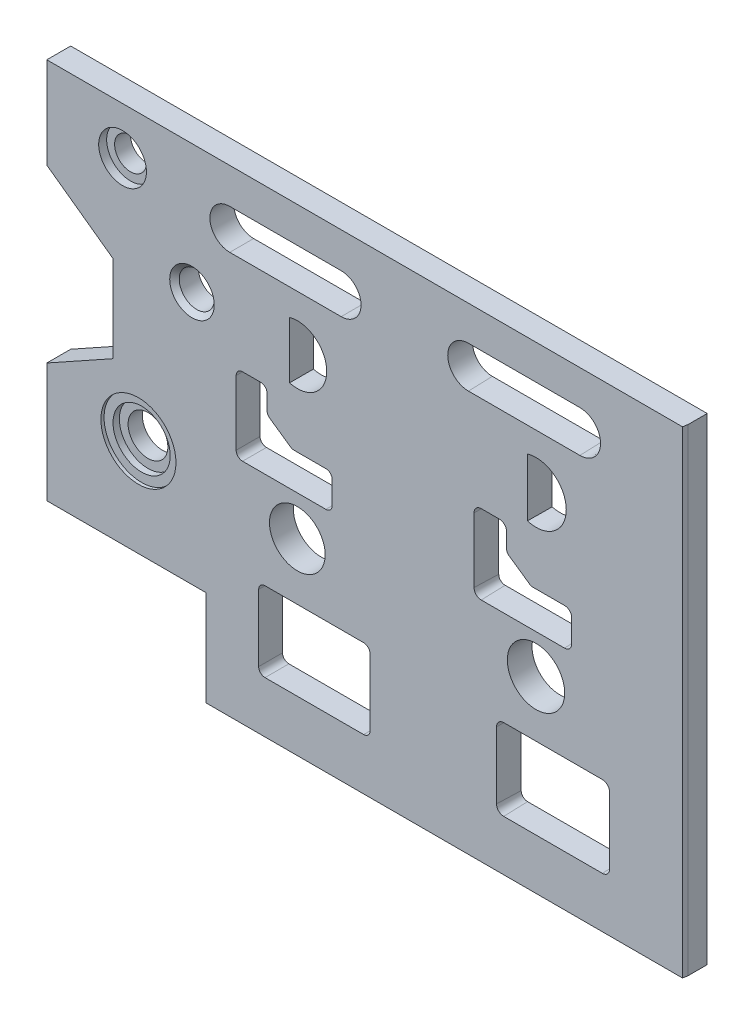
ISO-10303-21;
HEADER;
FILE_DESCRIPTION(('STEP AP214'),'2;1');
FILE_NAME('part.step','',(''),(''),'','','');
FILE_SCHEMA(('AUTOMOTIVE_DESIGN { 1 0 10303 214 1 1 1 1 }'));
ENDSEC;
DATA;
#1=APPLICATION_CONTEXT('core data for automotive mechanical design processes');
#2=APPLICATION_PROTOCOL_DEFINITION('international standard','automotive_design',2000,#1);
#3=PRODUCT_CONTEXT('',#1,'mechanical');
#4=PRODUCT('Part','Part','',(#3));
#5=PRODUCT_RELATED_PRODUCT_CATEGORY('part','',(#4));
#6=PRODUCT_DEFINITION_FORMATION('','',#4);
#7=PRODUCT_DEFINITION_CONTEXT('part definition',#1,'design');
#8=PRODUCT_DEFINITION('design','',#6,#7);
#9=PRODUCT_DEFINITION_SHAPE('','',#8);
#10=(LENGTH_UNIT() NAMED_UNIT(*) SI_UNIT(.MILLI.,.METRE.));
#11=(NAMED_UNIT(*) PLANE_ANGLE_UNIT() SI_UNIT($,.RADIAN.));
#12=(NAMED_UNIT(*) SI_UNIT($,.STERADIAN.) SOLID_ANGLE_UNIT());
#13=UNCERTAINTY_MEASURE_WITH_UNIT(LENGTH_MEASURE(1.E-05),#10,'distance_accuracy_value','');
#14=(GEOMETRIC_REPRESENTATION_CONTEXT(3) GLOBAL_UNCERTAINTY_ASSIGNED_CONTEXT((#13)) GLOBAL_UNIT_ASSIGNED_CONTEXT((#10,
#11,#12)) REPRESENTATION_CONTEXT('',''));
#15=CARTESIAN_POINT('',(0.,0.,0.));
#16=DIRECTION('',(0.,0.,1.));
#17=DIRECTION('',(1.,0.,0.));
#18=AXIS2_PLACEMENT_3D('',#15,#16,#17);
#19=CARTESIAN_POINT('',(57.5658407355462,121.326164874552,9.));
#20=DIRECTION('',(0.,0.,1.));
#21=DIRECTION('',(1.,0.,0.));
#22=AXIS2_PLACEMENT_3D('',#19,#20,#21);
#23=CYLINDRICAL_SURFACE('',#22,17.9701322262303);
#24=CARTESIAN_POINT('',(57.5658407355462,121.326164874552,9.));
#25=DIRECTION('',(0.,0.,1.));
#26=DIRECTION('',(1.,0.,0.));
#27=AXIS2_PLACEMENT_3D('',#24,#25,#26);
#28=CIRCLE('',#27,17.9701322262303);
#29=CARTESIAN_POINT('',(75.5359729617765,121.326164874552,9.));
#30=VERTEX_POINT('',#29);
#31=EDGE_CURVE('E856',#30,#30,#28,.T.);
#32=ORIENTED_EDGE('',*,*,#31,.F.);
#33=EDGE_LOOP('',(#32));
#34=FACE_BOUND('',#33,.T.);
#35=CARTESIAN_POINT('',(57.5658407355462,121.326164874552,13.));
#36=DIRECTION('',(0.,0.,1.));
#37=DIRECTION('',(1.,0.,0.));
#38=AXIS2_PLACEMENT_3D('',#35,#36,#37);
#39=CIRCLE('',#38,17.9701322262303);
#40=CARTESIAN_POINT('',(75.5359729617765,121.326164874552,13.));
#41=VERTEX_POINT('',#40);
#42=EDGE_CURVE('E859',#41,#41,#39,.F.);
#43=ORIENTED_EDGE('',*,*,#42,.F.);
#44=EDGE_LOOP('',(#43));
#45=FACE_BOUND('',#44,.T.);
#46=ADVANCED_FACE('F40',(#34,#45),#23,.F.);
#47=CARTESIAN_POINT('',(57.5658407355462,121.326164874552,0.));
#48=DIRECTION('',(0.,0.,1.));
#49=DIRECTION('',(1.,0.,0.));
#50=AXIS2_PLACEMENT_3D('',#47,#48,#49);
#51=CYLINDRICAL_SURFACE('',#50,12.5);
#52=CARTESIAN_POINT('',(57.5658407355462,121.326164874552,0.));
#53=DIRECTION('',(0.,0.,1.));
#54=DIRECTION('',(1.,0.,0.));
#55=AXIS2_PLACEMENT_3D('',#52,#53,#54);
#56=CIRCLE('',#55,12.5);
#57=CARTESIAN_POINT('',(70.0658407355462,121.326164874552,0.));
#58=VERTEX_POINT('',#57);
#59=EDGE_CURVE('E845',#58,#58,#56,.T.);
#60=ORIENTED_EDGE('',*,*,#59,.F.);
#61=EDGE_LOOP('',(#60));
#62=FACE_BOUND('',#61,.T.);
#63=CARTESIAN_POINT('',(57.5658407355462,121.326164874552,9.));
#64=DIRECTION('',(0.,0.,1.));
#65=DIRECTION('',(1.,0.,0.));
#66=AXIS2_PLACEMENT_3D('',#63,#64,#65);
#67=CIRCLE('',#66,12.5);
#68=CARTESIAN_POINT('',(70.0658407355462,121.326164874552,9.));
#69=VERTEX_POINT('',#68);
#70=EDGE_CURVE('E853',#69,#69,#67,.F.);
#71=ORIENTED_EDGE('',*,*,#70,.F.);
#72=EDGE_LOOP('',(#71));
#73=FACE_BOUND('',#72,.T.);
#74=ADVANCED_FACE('F791',(#62,#73),#51,.F.);
#75=CARTESIAN_POINT('',(47.5923328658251,270.30543867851,0.));
#76=DIRECTION('',(0.,0.,1.));
#77=DIRECTION('',(1.,0.,0.));
#78=AXIS2_PLACEMENT_3D('',#75,#76,#77);
#79=CYLINDRICAL_SURFACE('',#78,10.);
#80=CARTESIAN_POINT('',(47.5923328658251,270.30543867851,0.));
#81=DIRECTION('',(0.,0.,1.));
#82=DIRECTION('',(1.,0.,0.));
#83=AXIS2_PLACEMENT_3D('',#80,#81,#82);
#84=CIRCLE('',#83,10.);
#85=CARTESIAN_POINT('',(57.5923328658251,270.30543867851,0.));
#86=VERTEX_POINT('',#85);
#87=EDGE_CURVE('E839',#86,#86,#84,.T.);
#88=ORIENTED_EDGE('',*,*,#87,.F.);
#89=EDGE_LOOP('',(#88));
#90=FACE_BOUND('',#89,.T.);
#91=CARTESIAN_POINT('',(47.5923328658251,270.30543867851,10.));
#92=DIRECTION('',(0.,0.,1.));
#93=DIRECTION('',(1.,0.,0.));
#94=AXIS2_PLACEMENT_3D('',#91,#92,#93);
#95=CIRCLE('',#94,10.);
#96=CARTESIAN_POINT('',(57.5923328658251,270.30543867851,10.));
#97=VERTEX_POINT('',#96);
#98=EDGE_CURVE('E848',#97,#97,#95,.F.);
#99=ORIENTED_EDGE('',*,*,#98,.F.);
#100=EDGE_LOOP('',(#99));
#101=FACE_BOUND('',#100,.T.);
#102=ADVANCED_FACE('F797',(#90,#101),#79,.F.);
#103=CARTESIAN_POINT('',(0.,0.,15.));
#104=DIRECTION('',(1.,0.,0.));
#105=DIRECTION('',(0.,0.,-1.));
#106=AXIS2_PLACEMENT_3D('',#103,#104,#105);
#107=PLANE('',#106);
#108=DIRECTION('',(0.,-1.,0.));
#109=VECTOR('',#108,1.);
#110=CARTESIAN_POINT('',(0.,0.,15.));
#111=LINE('',#110,#109);
#112=CARTESIAN_POINT('',(0.,134.976525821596,15.));
#113=VERTEX_POINT('',#112);
#114=CARTESIAN_POINT('',(0.,60.,15.));
#115=VERTEX_POINT('',#114);
#116=EDGE_CURVE('E899',#113,#115,#111,.T.);
#117=ORIENTED_EDGE('',*,*,#116,.F.);
#118=DIRECTION('',(0.,0.,-1.));
#119=VECTOR('',#118,1.);
#120=CARTESIAN_POINT('',(0.,134.976525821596,15.));
#121=LINE('',#120,#119);
#122=CARTESIAN_POINT('',(0.,134.976525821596,0.));
#123=VERTEX_POINT('',#122);
#124=EDGE_CURVE('E931',#113,#123,#121,.T.);
#125=ORIENTED_EDGE('',*,*,#124,.T.);
#126=DIRECTION('',(0.,-1.,0.));
#127=VECTOR('',#126,1.);
#128=CARTESIAN_POINT('',(0.,0.,0.));
#129=LINE('',#128,#127);
#130=CARTESIAN_POINT('',(0.,60.,0.));
#131=VERTEX_POINT('',#130);
#132=EDGE_CURVE('E909',#123,#131,#129,.T.);
#133=ORIENTED_EDGE('',*,*,#132,.T.);
#134=DIRECTION('',(0.,0.,-1.));
#135=VECTOR('',#134,1.);
#136=CARTESIAN_POINT('',(0.,60.,15.));
#137=LINE('',#136,#135);
#138=EDGE_CURVE('E916',#115,#131,#137,.T.);
#139=ORIENTED_EDGE('',*,*,#138,.F.);
#140=EDGE_LOOP('',(#117,#125,#133,#139));
#141=FACE_BOUND('',#140,.T.);
#142=ADVANCED_FACE('F771',(#141),#107,.F.);
#143=CARTESIAN_POINT('',(0.,300.,0.));
#144=VERTEX_POINT('',#143);
#145=CARTESIAN_POINT('',(0.,242.64475743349,0.));
#146=VERTEX_POINT('',#145);
#147=EDGE_CURVE('E906',#144,#146,#129,.T.);
#148=ORIENTED_EDGE('',*,*,#147,.T.);
#149=DIRECTION('',(0.,0.,-1.));
#150=VECTOR('',#149,1.);
#151=CARTESIAN_POINT('',(0.,242.64475743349,15.));
#152=LINE('',#151,#150);
#153=CARTESIAN_POINT('',(0.,242.64475743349,15.));
#154=VERTEX_POINT('',#153);
#155=EDGE_CURVE('E936',#154,#146,#152,.T.);
#156=ORIENTED_EDGE('',*,*,#155,.F.);
#157=CARTESIAN_POINT('',(0.,300.,15.));
#158=VERTEX_POINT('',#157);
#159=EDGE_CURVE('E913',#158,#154,#111,.T.);
#160=ORIENTED_EDGE('',*,*,#159,.F.);
#161=DIRECTION('',(0.,0.,-1.));
#162=VECTOR('',#161,1.);
#163=CARTESIAN_POINT('',(0.,300.,15.));
#164=LINE('',#163,#162);
#165=EDGE_CURVE('E893',#158,#144,#164,.T.);
#166=ORIENTED_EDGE('',*,*,#165,.T.);
#167=EDGE_LOOP('',(#148,#156,#160,#166));
#168=FACE_BOUND('',#167,.T.);
#169=ADVANCED_FACE('F768',(#168),#107,.F.);
#170=CARTESIAN_POINT('',(0.,0.,15.));
#171=DIRECTION('',(0.,1.,0.));
#172=DIRECTION('',(0.,0.,1.));
#173=AXIS2_PLACEMENT_3D('',#170,#171,#172);
#174=PLANE('',#173);
#175=DIRECTION('',(0.,0.,-1.));
#176=VECTOR('',#175,1.);
#177=CARTESIAN_POINT('',(400.,0.,15.));
#178=LINE('',#177,#176);
#179=CARTESIAN_POINT('',(400.,0.,12.));
#180=VERTEX_POINT('',#179);
#181=CARTESIAN_POINT('',(400.,0.,0.));
#182=VERTEX_POINT('',#181);
#183=EDGE_CURVE('E885',#180,#182,#178,.T.);
#184=ORIENTED_EDGE('',*,*,#183,.F.);
#185=DIRECTION('',(0.173648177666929,0.,-0.984807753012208));
#186=VECTOR('',#185,1.);
#187=CARTESIAN_POINT('',(399.471019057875,0.,15.));
#188=LINE('',#187,#186);
#189=CARTESIAN_POINT('',(399.471019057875,0.,15.));
#190=VERTEX_POINT('',#189);
#191=EDGE_CURVE('E11',#180,#190,#188,.F.);
#192=ORIENTED_EDGE('',*,*,#191,.T.);
#193=DIRECTION('',(1.,0.,0.));
#194=VECTOR('',#193,1.);
#195=CARTESIAN_POINT('',(0.,0.,15.));
#196=LINE('',#195,#194);
#197=CARTESIAN_POINT('',(100.,0.,15.));
#198=VERTEX_POINT('',#197);
#199=EDGE_CURVE('E911',#198,#190,#196,.T.);
#200=ORIENTED_EDGE('',*,*,#199,.F.);
#201=DIRECTION('',(0.,0.,-1.));
#202=VECTOR('',#201,1.);
#203=CARTESIAN_POINT('',(100.,0.,15.));
#204=LINE('',#203,#202);
#205=CARTESIAN_POINT('',(100.,0.,0.));
#206=VERTEX_POINT('',#205);
#207=EDGE_CURVE('E922',#198,#206,#204,.T.);
#208=ORIENTED_EDGE('',*,*,#207,.T.);
#209=DIRECTION('',(1.,0.,0.));
#210=VECTOR('',#209,1.);
#211=CARTESIAN_POINT('',(0.,0.,0.));
#212=LINE('',#211,#210);
#213=EDGE_CURVE('E903',#206,#182,#212,.T.);
#214=ORIENTED_EDGE('',*,*,#213,.T.);
#215=EDGE_LOOP('',(#184,#192,#200,#208,#214));
#216=FACE_BOUND('',#215,.T.);
#217=ADVANCED_FACE('F765',(#216),#174,.F.);
#218=CARTESIAN_POINT('',(400.,0.,15.));
#219=DIRECTION('',(-1.,0.,0.));
#220=DIRECTION('',(0.,0.,1.));
#221=AXIS2_PLACEMENT_3D('',#218,#219,#220);
#222=PLANE('',#221);
#223=DIRECTION('',(0.,0.,-1.));
#224=VECTOR('',#223,1.);
#225=CARTESIAN_POINT('',(400.,300.,15.));
#226=LINE('',#225,#224);
#227=CARTESIAN_POINT('',(400.,300.,12.));
#228=VERTEX_POINT('',#227);
#229=CARTESIAN_POINT('',(400.,300.,0.));
#230=VERTEX_POINT('',#229);
#231=EDGE_CURVE('E891',#228,#230,#226,.T.);
#232=ORIENTED_EDGE('',*,*,#231,.F.);
#233=DIRECTION('',(0.,-1.,0.));
#234=VECTOR('',#233,1.);
#235=CARTESIAN_POINT('',(400.,0.,12.));
#236=LINE('',#235,#234);
#237=EDGE_CURVE('E48',#228,#180,#236,.T.);
#238=ORIENTED_EDGE('',*,*,#237,.T.);
#239=ORIENTED_EDGE('',*,*,#183,.T.);
#240=DIRECTION('',(0.,1.,0.));
#241=VECTOR('',#240,1.);
#242=CARTESIAN_POINT('',(400.,0.,0.));
#243=LINE('',#242,#241);
#244=EDGE_CURVE('E900',#182,#230,#243,.T.);
#245=ORIENTED_EDGE('',*,*,#244,.T.);
#246=EDGE_LOOP('',(#232,#238,#239,#245));
#247=FACE_BOUND('',#246,.T.);
#248=ADVANCED_FACE('F762',(#247),#222,.F.);
#249=CARTESIAN_POINT('',(0.,300.,15.));
#250=DIRECTION('',(0.,-1.,0.));
#251=DIRECTION('',(0.,0.,-1.));
#252=AXIS2_PLACEMENT_3D('',#249,#250,#251);
#253=PLANE('',#252);
#254=DIRECTION('',(-1.,0.,0.));
#255=VECTOR('',#254,1.);
#256=CARTESIAN_POINT('',(0.,300.,15.));
#257=LINE('',#256,#255);
#258=CARTESIAN_POINT('',(399.471019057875,300.,15.));
#259=VERTEX_POINT('',#258);
#260=EDGE_CURVE('E896',#259,#158,#257,.T.);
#261=ORIENTED_EDGE('',*,*,#260,.F.);
#262=DIRECTION('',(-0.173648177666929,0.,0.984807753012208));
#263=VECTOR('',#262,1.);
#264=CARTESIAN_POINT('',(399.471019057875,300.,15.));
#265=LINE('',#264,#263);
#266=EDGE_CURVE('E62',#259,#228,#265,.F.);
#267=ORIENTED_EDGE('',*,*,#266,.T.);
#268=ORIENTED_EDGE('',*,*,#231,.T.);
#269=DIRECTION('',(-1.,0.,0.));
#270=VECTOR('',#269,1.);
#271=CARTESIAN_POINT('',(0.,300.,0.));
#272=LINE('',#271,#270);
#273=EDGE_CURVE('E897',#230,#144,#272,.T.);
#274=ORIENTED_EDGE('',*,*,#273,.T.);
#275=ORIENTED_EDGE('',*,*,#165,.F.);
#276=EDGE_LOOP('',(#261,#267,#268,#274,#275));
#277=FACE_BOUND('',#276,.T.);
#278=ADVANCED_FACE('F755',(#277),#253,.F.);
#279=CARTESIAN_POINT('',(0.,300.,15.));
#280=DIRECTION('',(0.,0.,-1.));
#281=DIRECTION('',(-1.,0.,0.));
#282=AXIS2_PLACEMENT_3D('',#279,#280,#281);
#283=PLANE('',#282);
#284=CARTESIAN_POINT('',(57.5658407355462,121.326164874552,15.));
#285=DIRECTION('',(0.,0.,1.));
#286=DIRECTION('',(1.,0.,0.));
#287=AXIS2_PLACEMENT_3D('',#284,#285,#286);
#288=CIRCLE('',#287,23.5886669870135);
#289=CARTESIAN_POINT('',(81.1545077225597,121.326164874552,15.));
#290=VERTEX_POINT('',#289);
#291=EDGE_CURVE('E860',#290,#290,#288,.T.);
#292=ORIENTED_EDGE('',*,*,#291,.F.);
#293=EDGE_LOOP('',(#292));
#294=FACE_BOUND('',#293,.T.);
#295=CARTESIAN_POINT('',(91.2264297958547,219.19121084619,15.));
#296=DIRECTION('',(0.,0.,-1.));
#297=DIRECTION('',(-1.,0.,0.));
#298=AXIS2_PLACEMENT_3D('',#295,#296,#297);
#299=CIRCLE('',#298,14.);
#300=CARTESIAN_POINT('',(77.2264297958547,219.19121084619,15.));
#301=VERTEX_POINT('',#300);
#302=EDGE_CURVE('E877',#301,#301,#299,.T.);
#303=ORIENTED_EDGE('',*,*,#302,.T.);
#304=EDGE_LOOP('',(#303));
#305=FACE_BOUND('',#304,.T.);
#306=CARTESIAN_POINT('',(47.5923328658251,270.30543867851,15.));
#307=DIRECTION('',(0.,0.,1.));
#308=DIRECTION('',(1.,0.,0.));
#309=AXIS2_PLACEMENT_3D('',#306,#307,#308);
#310=CIRCLE('',#309,15.);
#311=CARTESIAN_POINT('',(62.5923328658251,270.30543867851,15.));
#312=VERTEX_POINT('',#311);
#313=EDGE_CURVE('E849',#312,#312,#310,.T.);
#314=ORIENTED_EDGE('',*,*,#313,.F.);
#315=EDGE_LOOP('',(#314));
#316=FACE_BOUND('',#315,.T.);
#317=CARTESIAN_POINT('',(307.434743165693,118.075117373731,15.0000000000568));
#318=DIRECTION('',(0.,0.,-1.));
#319=DIRECTION('',(-1.,0.,0.));
#320=AXIS2_PLACEMENT_3D('',#317,#318,#319);
#321=CIRCLE('',#320,18.0238115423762);
#322=CARTESIAN_POINT('',(289.410931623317,118.075117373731,15.0000000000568));
#323=VERTEX_POINT('',#322);
#324=EDGE_CURVE('E832',#323,#323,#321,.T.);
#325=ORIENTED_EDGE('',*,*,#324,.T.);
#326=EDGE_LOOP('',(#325));
#327=FACE_BOUND('',#326,.T.);
#328=DIRECTION('',(-1.,0.,0.));
#329=VECTOR('',#328,1.);
#330=CARTESIAN_POINT('',(264.97652581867,252.175718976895,15.0000000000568));
#331=LINE('',#330,#329);
#332=CARTESIAN_POINT('',(334.97652581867,252.175718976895,15.0000000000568));
#333=VERTEX_POINT('',#332);
#334=CARTESIAN_POINT('',(264.97652581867,252.175718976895,15.0000000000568));
#335=VERTEX_POINT('',#334);
#336=EDGE_CURVE('E491',#333,#335,#331,.T.);
#337=ORIENTED_EDGE('',*,*,#336,.T.);
#338=CARTESIAN_POINT('',(264.97652581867,265.199530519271,15.0000000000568));
#339=DIRECTION('',(0.,0.,1.));
#340=DIRECTION('',(1.,0.,0.));
#341=AXIS2_PLACEMENT_3D('',#338,#339,#340);
#342=CIRCLE('',#341,13.0238115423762);
#343=CARTESIAN_POINT('',(264.97652581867,278.223342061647,15.0000000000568));
#344=VERTEX_POINT('',#343);
#345=EDGE_CURVE('E484',#335,#344,#342,.F.);
#346=ORIENTED_EDGE('',*,*,#345,.T.);
#347=DIRECTION('',(1.,0.,0.));
#348=VECTOR('',#347,1.);
#349=CARTESIAN_POINT('',(264.97652581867,278.223342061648,15.0000000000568));
#350=LINE('',#349,#348);
#351=CARTESIAN_POINT('',(334.97652581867,278.223342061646,15.));
#352=VERTEX_POINT('',#351);
#353=EDGE_CURVE('E490',#344,#352,#350,.T.);
#354=ORIENTED_EDGE('',*,*,#353,.T.);
#355=CARTESIAN_POINT('',(334.97652581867,265.199530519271,15.0000000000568));
#356=DIRECTION('',(0.,0.,1.));
#357=DIRECTION('',(1.,0.,0.));
#358=AXIS2_PLACEMENT_3D('',#355,#356,#357);
#359=CIRCLE('',#358,13.0238115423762);
#360=EDGE_CURVE('E464',#352,#333,#359,.F.);
#361=ORIENTED_EDGE('',*,*,#360,.T.);
#362=EDGE_LOOP('',(#337,#346,#354,#361));
#363=FACE_BOUND('',#362,.T.);
#364=DIRECTION('',(0.,1.,0.));
#365=VECTOR('',#364,1.);
#366=CARTESIAN_POINT('',(302.023919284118,218.262910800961,15.0000000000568));
#367=LINE('',#366,#365);
#368=CARTESIAN_POINT('',(302.023919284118,200.041166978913,15.0000000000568));
#369=VERTEX_POINT('',#368);
#370=CARTESIAN_POINT('',(302.02391928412,236.48465462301,15.));
#371=VERTEX_POINT('',#370);
#372=EDGE_CURVE('E1366',#369,#371,#367,.T.);
#373=ORIENTED_EDGE('',*,*,#372,.T.);
#374=CARTESIAN_POINT('',(307.434743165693,218.262910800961,15.0000000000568));
#375=DIRECTION('',(0.,0.,-1.));
#376=DIRECTION('',(-1.,0.,0.));
#377=AXIS2_PLACEMENT_3D('',#374,#375,#376);
#378=CIRCLE('',#377,19.0081288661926);
#379=EDGE_CURVE('E505',#371,#369,#378,.T.);
#380=ORIENTED_EDGE('',*,*,#379,.T.);
#381=EDGE_LOOP('',(#373,#380));
#382=FACE_BOUND('',#381,.T.);
#383=DIRECTION('',(0.,1.,0.));
#384=VECTOR('',#383,1.);
#385=CARTESIAN_POINT('',(282.606078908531,78.3161189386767,15.0000000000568));
#386=LINE('',#385,#384);
#387=CARTESIAN_POINT('',(282.606078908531,36.3161189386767,15.0000000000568));
#388=VERTEX_POINT('',#387);
#389=CARTESIAN_POINT('',(282.606078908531,78.3161189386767,15.0000000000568));
#390=VERTEX_POINT('',#389);
#391=EDGE_CURVE('E1319',#388,#390,#386,.T.);
#392=ORIENTED_EDGE('',*,*,#391,.T.);
#393=CARTESIAN_POINT('',(287.129890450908,78.3161189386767,15.0000000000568));
#394=DIRECTION('',(0.,0.,1.));
#395=DIRECTION('',(1.,0.,0.));
#396=AXIS2_PLACEMENT_3D('',#393,#394,#395);
#397=CIRCLE('',#396,4.52381154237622);
#398=CARTESIAN_POINT('',(287.129890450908,82.8399304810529,15.0000000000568));
#399=VERTEX_POINT('',#398);
#400=EDGE_CURVE('E1325',#390,#399,#397,.F.);
#401=ORIENTED_EDGE('',*,*,#400,.T.);
#402=DIRECTION('',(1.,0.,0.));
#403=VECTOR('',#402,1.);
#404=CARTESIAN_POINT('',(287.129890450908,82.8399304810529,15.0000000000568));
#405=LINE('',#404,#403);
#406=CARTESIAN_POINT('',(349.129890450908,82.8399304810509,15.));
#407=VERTEX_POINT('',#406);
#408=EDGE_CURVE('E1321',#399,#407,#405,.T.);
#409=ORIENTED_EDGE('',*,*,#408,.T.);
#410=CARTESIAN_POINT('',(349.129890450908,78.3161189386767,15.0000000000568));
#411=DIRECTION('',(0.,0.,1.));
#412=DIRECTION('',(1.,0.,0.));
#413=AXIS2_PLACEMENT_3D('',#410,#411,#412);
#414=CIRCLE('',#413,4.52381154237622);
#415=CARTESIAN_POINT('',(353.653701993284,78.3161189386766,15.0000000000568));
#416=VERTEX_POINT('',#415);
#417=EDGE_CURVE('E1324',#407,#416,#414,.F.);
#418=ORIENTED_EDGE('',*,*,#417,.T.);
#419=DIRECTION('',(0.,-1.,0.));
#420=VECTOR('',#419,1.);
#421=CARTESIAN_POINT('',(353.653701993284,78.3161189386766,15.0000000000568));
#422=LINE('',#421,#420);
#423=CARTESIAN_POINT('',(353.653701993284,36.3161189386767,15.0000000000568));
#424=VERTEX_POINT('',#423);
#425=EDGE_CURVE('E1328',#416,#424,#422,.T.);
#426=ORIENTED_EDGE('',*,*,#425,.T.);
#427=CARTESIAN_POINT('',(349.129890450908,36.3161189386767,15.0000000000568));
#428=DIRECTION('',(0.,0.,1.));
#429=DIRECTION('',(1.,0.,0.));
#430=AXIS2_PLACEMENT_3D('',#427,#428,#429);
#431=CIRCLE('',#430,4.52381154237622);
#432=CARTESIAN_POINT('',(349.129890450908,31.7923073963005,15.0000000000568));
#433=VERTEX_POINT('',#432);
#434=EDGE_CURVE('E1331',#424,#433,#431,.F.);
#435=ORIENTED_EDGE('',*,*,#434,.T.);
#436=DIRECTION('',(-1.,0.,0.));
#437=VECTOR('',#436,1.);
#438=CARTESIAN_POINT('',(287.129890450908,31.7923073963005,15.0000000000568));
#439=LINE('',#438,#437);
#440=CARTESIAN_POINT('',(287.129890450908,31.7923073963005,15.0000000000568));
#441=VERTEX_POINT('',#440);
#442=EDGE_CURVE('E1334',#433,#441,#439,.T.);
#443=ORIENTED_EDGE('',*,*,#442,.T.);
#444=CARTESIAN_POINT('',(287.129890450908,36.3161189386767,15.0000000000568));
#445=DIRECTION('',(0.,0.,1.));
#446=DIRECTION('',(1.,0.,0.));
#447=AXIS2_PLACEMENT_3D('',#444,#445,#446);
#448=CIRCLE('',#447,4.52381154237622);
#449=EDGE_CURVE('E1337',#441,#388,#448,.F.);
#450=ORIENTED_EDGE('',*,*,#449,.T.);
#451=EDGE_LOOP('',(#392,#401,#409,#418,#426,#435,#443,#450));
#452=FACE_BOUND('',#451,.T.);
#453=DIRECTION('',(0.,-1.,0.));
#454=VECTOR('',#453,1.);
#455=CARTESIAN_POINT('',(288.933827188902,178.22969410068,15.0000000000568));
#456=LINE('',#455,#454);
#457=CARTESIAN_POINT('',(288.933827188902,187.704225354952,15.0000000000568));
#458=VERTEX_POINT('',#457);
#459=CARTESIAN_POINT('',(288.933827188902,178.22969410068,15.0000000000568));
#460=VERTEX_POINT('',#459);
#461=EDGE_CURVE('E1219',#458,#460,#456,.T.);
#462=ORIENTED_EDGE('',*,*,#461,.T.);
#463=CARTESIAN_POINT('',(292.410015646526,178.22969410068,15.0000000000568));
#464=DIRECTION('',(0.,0.,-1.));
#465=DIRECTION('',(-1.,0.,0.));
#466=AXIS2_PLACEMENT_3D('',#463,#464,#465);
#467=CIRCLE('',#466,3.4761884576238);
#468=CARTESIAN_POINT('',(290.424887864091,175.37607291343,15.0000000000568));
#469=VERTEX_POINT('',#468);
#470=EDGE_CURVE('E1225',#460,#469,#467,.F.);
#471=ORIENTED_EDGE('',*,*,#470,.T.);
#472=DIRECTION('',(0.820905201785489,-0.571064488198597,0.));
#473=VECTOR('',#472,1.);
#474=CARTESIAN_POINT('',(290.424887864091,175.37607291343,15.0000000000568));
#475=LINE('',#474,#473);
#476=CARTESIAN_POINT('',(303.449615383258,166.315392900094,15.));
#477=VERTEX_POINT('',#476);
#478=EDGE_CURVE('E1221',#469,#477,#475,.T.);
#479=ORIENTED_EDGE('',*,*,#478,.T.);
#480=CARTESIAN_POINT('',(305.434743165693,169.169014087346,15.0000000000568));
#481=DIRECTION('',(0.,0.,-1.));
#482=DIRECTION('',(-1.,0.,0.));
#483=AXIS2_PLACEMENT_3D('',#480,#481,#482);
#484=CIRCLE('',#483,3.47618845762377);
#485=CARTESIAN_POINT('',(305.434743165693,165.692825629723,15.0000000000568));
#486=VERTEX_POINT('',#485);
#487=EDGE_CURVE('E1224',#477,#486,#484,.F.);
#488=ORIENTED_EDGE('',*,*,#487,.T.);
#489=DIRECTION('',(1.,0.,0.));
#490=VECTOR('',#489,1.);
#491=CARTESIAN_POINT('',(292.410015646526,165.692825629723,15.0000000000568));
#492=LINE('',#491,#490);
#493=CARTESIAN_POINT('',(325.342723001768,165.692825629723,15.0000000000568));
#494=VERTEX_POINT('',#493);
#495=EDGE_CURVE('E1228',#486,#494,#492,.T.);
#496=ORIENTED_EDGE('',*,*,#495,.T.);
#497=CARTESIAN_POINT('',(325.342723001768,161.169014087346,15.0000000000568));
#498=DIRECTION('',(0.,0.,-1.));
#499=DIRECTION('',(-1.,0.,0.));
#500=AXIS2_PLACEMENT_3D('',#497,#498,#499);
#501=CIRCLE('',#500,4.52381154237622);
#502=CARTESIAN_POINT('',(329.866534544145,161.169014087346,15.0000000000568));
#503=VERTEX_POINT('',#502);
#504=EDGE_CURVE('E1231',#494,#503,#501,.T.);
#505=ORIENTED_EDGE('',*,*,#504,.T.);
#506=DIRECTION('',(0.,-1.,0.));
#507=VECTOR('',#506,1.);
#508=CARTESIAN_POINT('',(329.866534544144,178.22969410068,15.0000000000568));
#509=LINE('',#508,#507);
#510=CARTESIAN_POINT('',(329.866534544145,147.015649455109,15.0000000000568));
#511=VERTEX_POINT('',#510);
#512=EDGE_CURVE('E1234',#503,#511,#509,.T.);
#513=ORIENTED_EDGE('',*,*,#512,.T.);
#514=CARTESIAN_POINT('',(325.342723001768,147.015649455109,15.0000000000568));
#515=DIRECTION('',(0.,0.,-1.));
#516=DIRECTION('',(-1.,0.,0.));
#517=AXIS2_PLACEMENT_3D('',#514,#515,#516);
#518=CIRCLE('',#517,4.52381154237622);
#519=CARTESIAN_POINT('',(325.342723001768,142.491837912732,15.0000000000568));
#520=VERTEX_POINT('',#519);
#521=EDGE_CURVE('E1237',#511,#520,#518,.T.);
#522=ORIENTED_EDGE('',*,*,#521,.T.);
#523=DIRECTION('',(-1.,0.,0.));
#524=VECTOR('',#523,1.);
#525=CARTESIAN_POINT('',(292.410015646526,142.491837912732,15.0000000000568));
#526=LINE('',#525,#524);
#527=CARTESIAN_POINT('',(273.004694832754,142.491837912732,15.0000000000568));
#528=VERTEX_POINT('',#527);
#529=EDGE_CURVE('E1240',#520,#528,#526,.T.);
#530=ORIENTED_EDGE('',*,*,#529,.T.);
#531=CARTESIAN_POINT('',(273.004694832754,147.015649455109,15.0000000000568));
#532=DIRECTION('',(0.,0.,-1.));
#533=DIRECTION('',(-1.,0.,0.));
#534=AXIS2_PLACEMENT_3D('',#531,#532,#533);
#535=CIRCLE('',#534,4.52381154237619);
#536=CARTESIAN_POINT('',(268.480883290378,147.015649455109,15.0000000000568));
#537=VERTEX_POINT('',#536);
#538=EDGE_CURVE('E1243',#528,#537,#535,.T.);
#539=ORIENTED_EDGE('',*,*,#538,.T.);
#540=DIRECTION('',(0.,1.,0.));
#541=VECTOR('',#540,1.);
#542=CARTESIAN_POINT('',(268.480883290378,178.22969410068,15.0000000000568));
#543=LINE('',#542,#541);
#544=CARTESIAN_POINT('',(268.480883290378,187.704225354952,15.0000000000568));
#545=VERTEX_POINT('',#544);
#546=EDGE_CURVE('E1246',#537,#545,#543,.T.);
#547=ORIENTED_EDGE('',*,*,#546,.T.);
#548=CARTESIAN_POINT('',(273.004694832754,187.704225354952,15.0000000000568));
#549=DIRECTION('',(0.,0.,-1.));
#550=DIRECTION('',(-1.,0.,0.));
#551=AXIS2_PLACEMENT_3D('',#548,#549,#550);
#552=CIRCLE('',#551,4.52381154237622);
#553=CARTESIAN_POINT('',(273.004694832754,192.228036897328,15.0000000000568));
#554=VERTEX_POINT('',#553);
#555=EDGE_CURVE('E1249',#545,#554,#552,.T.);
#556=ORIENTED_EDGE('',*,*,#555,.T.);
#557=DIRECTION('',(1.,0.,0.));
#558=VECTOR('',#557,1.);
#559=CARTESIAN_POINT('',(292.410015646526,192.228036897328,15.0000000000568));
#560=LINE('',#559,#558);
#561=CARTESIAN_POINT('',(284.410015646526,192.228036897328,15.0000000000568));
#562=VERTEX_POINT('',#561);
#563=EDGE_CURVE('E1252',#554,#562,#560,.T.);
#564=ORIENTED_EDGE('',*,*,#563,.T.);
#565=CARTESIAN_POINT('',(284.410015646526,187.704225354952,15.0000000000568));
#566=DIRECTION('',(0.,0.,-1.));
#567=DIRECTION('',(-1.,0.,0.));
#568=AXIS2_PLACEMENT_3D('',#565,#566,#567);
#569=CIRCLE('',#568,4.52381154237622);
#570=EDGE_CURVE('E1255',#562,#458,#569,.T.);
#571=ORIENTED_EDGE('',*,*,#570,.T.);
#572=EDGE_LOOP('',(#462,#471,#479,#488,#496,#505,#513,#522,#530,#539,#547,#556,#564,#571));
#573=FACE_BOUND('',#572,.T.);
#574=DIRECTION('',(-1.,0.,0.));
#575=VECTOR('',#574,1.);
#576=CARTESIAN_POINT('',(114.976525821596,252.699530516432,15.));
#577=LINE('',#576,#575);
#578=CARTESIAN_POINT('',(184.976525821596,252.699530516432,15.));
#579=VERTEX_POINT('',#578);
#580=CARTESIAN_POINT('',(114.976525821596,252.699530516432,15.));
#581=VERTEX_POINT('',#580);
#582=EDGE_CURVE('E1164',#579,#581,#577,.T.);
#583=ORIENTED_EDGE('',*,*,#582,.T.);
#584=CARTESIAN_POINT('',(114.976525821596,265.199530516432,15.));
#585=DIRECTION('',(0.,0.,-1.));
#586=DIRECTION('',(1.,0.,0.));
#587=AXIS2_PLACEMENT_3D('',#584,#585,#586);
#588=CIRCLE('',#587,12.5);
#589=CARTESIAN_POINT('',(114.976525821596,277.699530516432,15.));
#590=VERTEX_POINT('',#589);
#591=EDGE_CURVE('E1172',#581,#590,#588,.T.);
#592=ORIENTED_EDGE('',*,*,#591,.T.);
#593=DIRECTION('',(1.,0.,0.));
#594=VECTOR('',#593,1.);
#595=CARTESIAN_POINT('',(114.976525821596,277.699530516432,15.));
#596=LINE('',#595,#594);
#597=CARTESIAN_POINT('',(184.976525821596,277.699530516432,15.));
#598=VERTEX_POINT('',#597);
#599=EDGE_CURVE('E1187',#590,#598,#596,.T.);
#600=ORIENTED_EDGE('',*,*,#599,.T.);
#601=CARTESIAN_POINT('',(184.976525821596,265.199530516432,15.));
#602=DIRECTION('',(0.,0.,-1.));
#603=DIRECTION('',(-1.,0.,0.));
#604=AXIS2_PLACEMENT_3D('',#601,#602,#603);
#605=CIRCLE('',#604,12.5);
#606=EDGE_CURVE('E1184',#598,#579,#605,.T.);
#607=ORIENTED_EDGE('',*,*,#606,.T.);
#608=EDGE_LOOP('',(#583,#592,#600,#607));
#609=FACE_BOUND('',#608,.T.);
#610=DIRECTION('',(0.,1.,0.));
#611=VECTOR('',#610,1.);
#612=CARTESIAN_POINT('',(152.547730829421,236.089494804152,15.));
#613=LINE('',#612,#611);
#614=CARTESIAN_POINT('',(152.547730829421,200.436326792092,15.));
#615=VERTEX_POINT('',#614);
#616=CARTESIAN_POINT('',(152.547730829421,236.089494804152,15.));
#617=VERTEX_POINT('',#616);
#618=EDGE_CURVE('E1147',#615,#617,#613,.T.);
#619=ORIENTED_EDGE('',*,*,#618,.T.);
#620=CARTESIAN_POINT('',(157.43474316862,218.262910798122,15.));
#621=DIRECTION('',(0.,0.,-1.));
#622=DIRECTION('',(-1.,0.,0.));
#623=AXIS2_PLACEMENT_3D('',#620,#621,#622);
#624=CIRCLE('',#623,18.4843173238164);
#625=EDGE_CURVE('E1152',#617,#615,#624,.T.);
#626=ORIENTED_EDGE('',*,*,#625,.T.);
#627=EDGE_LOOP('',(#619,#626));
#628=FACE_BOUND('',#627,.T.);
#629=DIRECTION('',(0.,1.,0.));
#630=VECTOR('',#629,1.);
#631=CARTESIAN_POINT('',(133.129890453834,78.3161189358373,15.));
#632=LINE('',#631,#630);
#633=CARTESIAN_POINT('',(133.129890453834,36.3161189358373,15.));
#634=VERTEX_POINT('',#633);
#635=CARTESIAN_POINT('',(133.129890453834,78.3161189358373,15.));
#636=VERTEX_POINT('',#635);
#637=EDGE_CURVE('E1084',#634,#636,#632,.T.);
#638=ORIENTED_EDGE('',*,*,#637,.T.);
#639=CARTESIAN_POINT('',(137.129890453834,78.3161189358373,15.));
#640=DIRECTION('',(0.,0.,-1.));
#641=DIRECTION('',(1.,0.,0.));
#642=AXIS2_PLACEMENT_3D('',#639,#640,#641);
#643=CIRCLE('',#642,4.);
#644=CARTESIAN_POINT('',(137.129890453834,82.3161189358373,15.));
#645=VERTEX_POINT('',#644);
#646=EDGE_CURVE('E1100',#636,#645,#643,.T.);
#647=ORIENTED_EDGE('',*,*,#646,.T.);
#648=DIRECTION('',(1.,0.,0.));
#649=VECTOR('',#648,1.);
#650=CARTESIAN_POINT('',(137.129890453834,82.3161189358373,15.));
#651=LINE('',#650,#649);
#652=CARTESIAN_POINT('',(199.129890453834,82.3161189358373,15.));
#653=VERTEX_POINT('',#652);
#654=EDGE_CURVE('E1139',#645,#653,#651,.T.);
#655=ORIENTED_EDGE('',*,*,#654,.T.);
#656=CARTESIAN_POINT('',(199.129890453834,78.3161189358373,15.));
#657=DIRECTION('',(0.,0.,-1.));
#658=DIRECTION('',(-1.,0.,0.));
#659=AXIS2_PLACEMENT_3D('',#656,#657,#658);
#660=CIRCLE('',#659,4.);
#661=CARTESIAN_POINT('',(203.129890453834,78.3161189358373,15.));
#662=VERTEX_POINT('',#661);
#663=EDGE_CURVE('E1136',#653,#662,#660,.T.);
#664=ORIENTED_EDGE('',*,*,#663,.T.);
#665=DIRECTION('',(0.,-1.,0.));
#666=VECTOR('',#665,1.);
#667=CARTESIAN_POINT('',(203.129890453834,78.3161189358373,15.));
#668=LINE('',#667,#666);
#669=CARTESIAN_POINT('',(203.129890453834,36.3161189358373,15.));
#670=VERTEX_POINT('',#669);
#671=EDGE_CURVE('E1133',#662,#670,#668,.T.);
#672=ORIENTED_EDGE('',*,*,#671,.T.);
#673=CARTESIAN_POINT('',(199.129890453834,36.3161189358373,15.));
#674=DIRECTION('',(0.,0.,-1.));
#675=DIRECTION('',(1.,0.,0.));
#676=AXIS2_PLACEMENT_3D('',#673,#674,#675);
#677=CIRCLE('',#676,4.);
#678=CARTESIAN_POINT('',(199.129890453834,32.3161189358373,15.));
#679=VERTEX_POINT('',#678);
#680=EDGE_CURVE('E1130',#670,#679,#677,.T.);
#681=ORIENTED_EDGE('',*,*,#680,.T.);
#682=DIRECTION('',(-1.,0.,0.));
#683=VECTOR('',#682,1.);
#684=CARTESIAN_POINT('',(137.129890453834,32.3161189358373,15.));
#685=LINE('',#684,#683);
#686=CARTESIAN_POINT('',(137.129890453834,32.3161189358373,15.));
#687=VERTEX_POINT('',#686);
#688=EDGE_CURVE('E1127',#679,#687,#685,.T.);
#689=ORIENTED_EDGE('',*,*,#688,.T.);
#690=CARTESIAN_POINT('',(137.129890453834,36.3161189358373,15.));
#691=DIRECTION('',(0.,0.,-1.));
#692=DIRECTION('',(1.,0.,0.));
#693=AXIS2_PLACEMENT_3D('',#690,#691,#692);
#694=CIRCLE('',#693,4.);
#695=EDGE_CURVE('E1124',#687,#634,#694,.T.);
#696=ORIENTED_EDGE('',*,*,#695,.T.);
#697=EDGE_LOOP('',(#638,#647,#655,#664,#672,#681,#689,#696));
#698=FACE_BOUND('',#697,.T.);
#699=DIRECTION('',(-1.,0.,0.));
#700=VECTOR('',#699,1.);
#701=CARTESIAN_POINT('',(123.004694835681,143.015649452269,15.));
#702=LINE('',#701,#700);
#703=CARTESIAN_POINT('',(175.342723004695,143.015649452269,15.));
#704=VERTEX_POINT('',#703);
#705=CARTESIAN_POINT('',(123.004694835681,143.015649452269,15.));
#706=VERTEX_POINT('',#705);
#707=EDGE_CURVE('E972',#704,#706,#702,.T.);
#708=ORIENTED_EDGE('',*,*,#707,.T.);
#709=CARTESIAN_POINT('',(123.004694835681,147.015649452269,15.));
#710=DIRECTION('',(0.,0.,-1.));
#711=DIRECTION('',(1.,0.,0.));
#712=AXIS2_PLACEMENT_3D('',#709,#710,#711);
#713=CIRCLE('',#712,4.);
#714=CARTESIAN_POINT('',(119.004694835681,147.015649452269,15.));
#715=VERTEX_POINT('',#714);
#716=EDGE_CURVE('E1000',#706,#715,#713,.T.);
#717=ORIENTED_EDGE('',*,*,#716,.T.);
#718=DIRECTION('',(0.,1.,0.));
#719=VECTOR('',#718,1.);
#720=CARTESIAN_POINT('',(119.004694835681,187.704225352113,15.));
#721=LINE('',#720,#719);
#722=CARTESIAN_POINT('',(119.004694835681,187.704225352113,15.));
#723=VERTEX_POINT('',#722);
#724=EDGE_CURVE('E1075',#715,#723,#721,.T.);
#725=ORIENTED_EDGE('',*,*,#724,.T.);
#726=CARTESIAN_POINT('',(123.004694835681,187.704225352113,15.));
#727=DIRECTION('',(0.,0.,-1.));
#728=DIRECTION('',(-1.,0.,0.));
#729=AXIS2_PLACEMENT_3D('',#726,#727,#728);
#730=CIRCLE('',#729,4.);
#731=CARTESIAN_POINT('',(123.004694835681,191.704225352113,15.));
#732=VERTEX_POINT('',#731);
#733=EDGE_CURVE('E1072',#723,#732,#730,.T.);
#734=ORIENTED_EDGE('',*,*,#733,.T.);
#735=DIRECTION('',(1.,0.,0.));
#736=VECTOR('',#735,1.);
#737=CARTESIAN_POINT('',(134.410015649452,191.704225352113,15.));
#738=LINE('',#737,#736);
#739=CARTESIAN_POINT('',(134.410015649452,191.704225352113,15.));
#740=VERTEX_POINT('',#739);
#741=EDGE_CURVE('E1069',#732,#740,#738,.T.);
#742=ORIENTED_EDGE('',*,*,#741,.T.);
#743=CARTESIAN_POINT('',(134.410015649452,187.704225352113,15.));
#744=DIRECTION('',(0.,0.,-1.));
#745=DIRECTION('',(1.,0.,0.));
#746=AXIS2_PLACEMENT_3D('',#743,#744,#745);
#747=CIRCLE('',#746,4.00000000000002);
#748=CARTESIAN_POINT('',(138.410015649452,187.704225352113,15.));
#749=VERTEX_POINT('',#748);
#750=EDGE_CURVE('E1066',#740,#749,#747,.T.);
#751=ORIENTED_EDGE('',*,*,#750,.T.);
#752=DIRECTION('',(0.,-1.,0.));
#753=VECTOR('',#752,1.);
#754=CARTESIAN_POINT('',(138.410015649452,178.229694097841,15.));
#755=LINE('',#754,#753);
#756=CARTESIAN_POINT('',(138.410015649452,178.229694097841,15.));
#757=VERTEX_POINT('',#756);
#758=EDGE_CURVE('E1063',#749,#757,#755,.T.);
#759=ORIENTED_EDGE('',*,*,#758,.T.);
#760=CARTESIAN_POINT('',(142.410015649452,178.229694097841,15.));
#761=DIRECTION('',(0.,0.,1.));
#762=DIRECTION('',(-1.,0.,0.));
#763=AXIS2_PLACEMENT_3D('',#760,#761,#762);
#764=CIRCLE('',#763,4.00000000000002);
#765=CARTESIAN_POINT('',(140.125757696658,174.946073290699,15.));
#766=VERTEX_POINT('',#765);
#767=EDGE_CURVE('E1060',#757,#766,#764,.T.);
#768=ORIENTED_EDGE('',*,*,#767,.T.);
#769=DIRECTION('',(0.820905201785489,-0.571064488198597,0.));
#770=VECTOR('',#769,1.);
#771=CARTESIAN_POINT('',(153.150485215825,165.885393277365,15.));
#772=LINE('',#771,#770);
#773=CARTESIAN_POINT('',(153.150485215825,165.885393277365,15.));
#774=VERTEX_POINT('',#773);
#775=EDGE_CURVE('E1057',#766,#774,#772,.T.);
#776=ORIENTED_EDGE('',*,*,#775,.T.);
#777=CARTESIAN_POINT('',(155.43474316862,169.169014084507,15.));
#778=DIRECTION('',(0.,0.,1.));
#779=DIRECTION('',(-1.,0.,0.));
#780=AXIS2_PLACEMENT_3D('',#777,#778,#779);
#781=CIRCLE('',#780,4.);
#782=CARTESIAN_POINT('',(155.43474316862,165.169014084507,15.));
#783=VERTEX_POINT('',#782);
#784=EDGE_CURVE('E1054',#774,#783,#781,.T.);
#785=ORIENTED_EDGE('',*,*,#784,.T.);
#786=DIRECTION('',(1.,0.,0.));
#787=VECTOR('',#786,1.);
#788=CARTESIAN_POINT('',(175.342723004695,165.169014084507,15.));
#789=LINE('',#788,#787);
#790=CARTESIAN_POINT('',(175.342723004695,165.169014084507,15.));
#791=VERTEX_POINT('',#790);
#792=EDGE_CURVE('E1051',#783,#791,#789,.T.);
#793=ORIENTED_EDGE('',*,*,#792,.T.);
#794=CARTESIAN_POINT('',(175.342723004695,161.169014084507,15.));
#795=DIRECTION('',(0.,0.,-1.));
#796=DIRECTION('',(1.,0.,0.));
#797=AXIS2_PLACEMENT_3D('',#794,#795,#796);
#798=CIRCLE('',#797,4.);
#799=CARTESIAN_POINT('',(179.342723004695,161.169014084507,15.));
#800=VERTEX_POINT('',#799);
#801=EDGE_CURVE('E1048',#791,#800,#798,.T.);
#802=ORIENTED_EDGE('',*,*,#801,.T.);
#803=DIRECTION('',(0.,-1.,0.));
#804=VECTOR('',#803,1.);
#805=CARTESIAN_POINT('',(179.342723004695,147.015649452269,15.));
#806=LINE('',#805,#804);
#807=CARTESIAN_POINT('',(179.342723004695,147.015649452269,15.));
#808=VERTEX_POINT('',#807);
#809=EDGE_CURVE('E1045',#800,#808,#806,.T.);
#810=ORIENTED_EDGE('',*,*,#809,.T.);
#811=CARTESIAN_POINT('',(175.342723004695,147.015649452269,15.));
#812=DIRECTION('',(0.,0.,-1.));
#813=DIRECTION('',(1.,0.,0.));
#814=AXIS2_PLACEMENT_3D('',#811,#812,#813);
#815=CIRCLE('',#814,4.);
#816=EDGE_CURVE('E1042',#808,#704,#815,.T.);
#817=ORIENTED_EDGE('',*,*,#816,.T.);
#818=EDGE_LOOP('',(#708,#717,#725,#734,#742,#751,#759,#768,#776,#785,#793,#802,#810,#817));
#819=FACE_BOUND('',#818,.T.);
#820=CARTESIAN_POINT('',(157.43474316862,118.075117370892,15.));
#821=DIRECTION('',(0.,0.,-1.));
#822=DIRECTION('',(-1.,0.,0.));
#823=AXIS2_PLACEMENT_3D('',#820,#821,#822);
#824=CIRCLE('',#823,17.5);
#825=CARTESIAN_POINT('',(139.93474316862,118.075117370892,15.));
#826=VERTEX_POINT('',#825);
#827=EDGE_CURVE('E954',#826,#826,#824,.T.);
#828=ORIENTED_EDGE('',*,*,#827,.T.);
#829=EDGE_LOOP('',(#828));
#830=FACE_BOUND('',#829,.T.);
#831=ORIENTED_EDGE('',*,*,#199,.T.);
#832=DIRECTION('',(0.,1.,0.));
#833=VECTOR('',#832,1.);
#834=CARTESIAN_POINT('',(399.471019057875,300.,15.));
#835=LINE('',#834,#833);
#836=EDGE_CURVE('E874',#190,#259,#835,.T.);
#837=ORIENTED_EDGE('',*,*,#836,.T.);
#838=ORIENTED_EDGE('',*,*,#260,.T.);
#839=ORIENTED_EDGE('',*,*,#159,.T.);
#840=DIRECTION('',(0.810839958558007,-0.585267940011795,0.));
#841=VECTOR('',#840,1.);
#842=CARTESIAN_POINT('',(41.6275430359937,212.597809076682,15.));
#843=LINE('',#842,#841);
#844=CARTESIAN_POINT('',(41.6275430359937,212.597809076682,15.));
#845=VERTEX_POINT('',#844);
#846=EDGE_CURVE('E947',#154,#845,#843,.T.);
#847=ORIENTED_EDGE('',*,*,#846,.T.);
#848=DIRECTION('',(0.,-1.,0.));
#849=VECTOR('',#848,1.);
#850=CARTESIAN_POINT('',(41.6275430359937,158.137715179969,15.));
#851=LINE('',#850,#849);
#852=CARTESIAN_POINT('',(41.6275430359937,158.137715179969,15.));
#853=VERTEX_POINT('',#852);
#854=EDGE_CURVE('E957',#845,#853,#851,.T.);
#855=ORIENTED_EDGE('',*,*,#854,.T.);
#856=DIRECTION('',(-0.873847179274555,-0.48620068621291,0.));
#857=VECTOR('',#856,1.);
#858=CARTESIAN_POINT('',(0.,134.976525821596,15.));
#859=LINE('',#858,#857);
#860=EDGE_CURVE('E939',#853,#113,#859,.T.);
#861=ORIENTED_EDGE('',*,*,#860,.T.);
#862=ORIENTED_EDGE('',*,*,#116,.T.);
#863=DIRECTION('',(1.,0.,0.));
#864=VECTOR('',#863,1.);
#865=CARTESIAN_POINT('',(0.,60.,15.));
#866=LINE('',#865,#864);
#867=CARTESIAN_POINT('',(100.,60.,15.));
#868=VERTEX_POINT('',#867);
#869=EDGE_CURVE('E927',#115,#868,#866,.T.);
#870=ORIENTED_EDGE('',*,*,#869,.T.);
#871=DIRECTION('',(0.,-1.,0.));
#872=VECTOR('',#871,1.);
#873=CARTESIAN_POINT('',(100.,0.,15.));
#874=LINE('',#873,#872);
#875=EDGE_CURVE('E920',#868,#198,#874,.T.);
#876=ORIENTED_EDGE('',*,*,#875,.T.);
#877=EDGE_LOOP('',(#831,#837,#838,#839,#847,#855,#861,#862,#870,#876));
#878=FACE_BOUND('',#877,.T.);
#879=ADVANCED_FACE('F752',(#294,#305,#316,#327,#363,#382,#452,#573,#609,#628,#698,#819,#830,
#878),#283,.F.);
#880=CARTESIAN_POINT('',(0.,300.,0.));
#881=DIRECTION('',(0.,0.,-1.));
#882=DIRECTION('',(-1.,0.,0.));
#883=AXIS2_PLACEMENT_3D('',#880,#881,#882);
#884=PLANE('',#883);
#885=ORIENTED_EDGE('',*,*,#59,.T.);
#886=EDGE_LOOP('',(#885));
#887=FACE_BOUND('',#886,.T.);
#888=CARTESIAN_POINT('',(91.2264297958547,219.19121084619,0.));
#889=DIRECTION('',(0.,0.,1.));
#890=DIRECTION('',(1.,0.,0.));
#891=AXIS2_PLACEMENT_3D('',#888,#889,#890);
#892=CIRCLE('',#891,11.);
#893=CARTESIAN_POINT('',(102.226429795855,219.19121084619,0.));
#894=VERTEX_POINT('',#893);
#895=EDGE_CURVE('E842',#894,#894,#892,.T.);
#896=ORIENTED_EDGE('',*,*,#895,.T.);
#897=EDGE_LOOP('',(#896));
#898=FACE_BOUND('',#897,.T.);
#899=ORIENTED_EDGE('',*,*,#87,.T.);
#900=EDGE_LOOP('',(#899));
#901=FACE_BOUND('',#900,.T.);
#902=CARTESIAN_POINT('',(307.434743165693,118.075117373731,5.6843418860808E-11));
#903=DIRECTION('',(0.,0.,-1.));
#904=DIRECTION('',(-1.,0.,0.));
#905=AXIS2_PLACEMENT_3D('',#902,#903,#904);
#906=CIRCLE('',#905,17.5);
#907=CARTESIAN_POINT('',(289.934743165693,118.075117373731,5.6843418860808E-11));
#908=VERTEX_POINT('',#907);
#909=EDGE_CURVE('E834',#908,#908,#906,.T.);
#910=ORIENTED_EDGE('',*,*,#909,.F.);
#911=EDGE_LOOP('',(#910));
#912=FACE_BOUND('',#911,.T.);
#913=CARTESIAN_POINT('',(264.97652581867,265.199530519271,5.6843418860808E-11));
#914=DIRECTION('',(0.,0.,-1.));
#915=DIRECTION('',(1.,0.,0.));
#916=AXIS2_PLACEMENT_3D('',#913,#914,#915);
#917=CIRCLE('',#916,12.5);
#918=CARTESIAN_POINT('',(264.97652581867,252.699530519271,5.6843418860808E-11));
#919=VERTEX_POINT('',#918);
#920=CARTESIAN_POINT('',(264.97652581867,277.699530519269,0.));
#921=VERTEX_POINT('',#920);
#922=EDGE_CURVE('E477',#919,#921,#917,.T.);
#923=ORIENTED_EDGE('',*,*,#922,.F.);
#924=DIRECTION('',(-1.,0.,0.));
#925=VECTOR('',#924,1.);
#926=CARTESIAN_POINT('',(264.97652581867,252.699530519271,5.6843418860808E-11));
#927=LINE('',#926,#925);
#928=CARTESIAN_POINT('',(334.97652581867,252.699530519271,5.6843418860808E-11));
#929=VERTEX_POINT('',#928);
#930=EDGE_CURVE('E482',#929,#919,#927,.T.);
#931=ORIENTED_EDGE('',*,*,#930,.F.);
#932=CARTESIAN_POINT('',(334.97652581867,265.199530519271,5.6843418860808E-11));
#933=DIRECTION('',(0.,0.,-1.));
#934=DIRECTION('',(-1.,0.,0.));
#935=AXIS2_PLACEMENT_3D('',#932,#933,#934);
#936=CIRCLE('',#935,12.5);
#937=CARTESIAN_POINT('',(334.97652581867,277.699530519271,5.6843418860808E-11));
#938=VERTEX_POINT('',#937);
#939=EDGE_CURVE('E461',#938,#929,#936,.T.);
#940=ORIENTED_EDGE('',*,*,#939,.F.);
#941=DIRECTION('',(1.,0.,0.));
#942=VECTOR('',#941,1.);
#943=CARTESIAN_POINT('',(264.97652581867,277.699530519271,5.6843418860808E-11));
#944=LINE('',#943,#942);
#945=EDGE_CURVE('E473',#921,#938,#944,.T.);
#946=ORIENTED_EDGE('',*,*,#945,.F.);
#947=EDGE_LOOP('',(#923,#931,#940,#946));
#948=FACE_BOUND('',#947,.T.);
#949=CARTESIAN_POINT('',(307.434743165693,218.262910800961,5.6843418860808E-11));
#950=DIRECTION('',(0.,0.,-1.));
#951=DIRECTION('',(-1.,0.,0.));
#952=AXIS2_PLACEMENT_3D('',#949,#950,#951);
#953=CIRCLE('',#952,18.4843173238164);
#954=CARTESIAN_POINT('',(302.547730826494,236.089494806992,5.6843418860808E-11));
#955=VERTEX_POINT('',#954);
#956=CARTESIAN_POINT('',(302.547730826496,200.436326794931,0.));
#957=VERTEX_POINT('',#956);
#958=EDGE_CURVE('E498',#955,#957,#953,.T.);
#959=ORIENTED_EDGE('',*,*,#958,.F.);
#960=DIRECTION('',(0.,1.,0.));
#961=VECTOR('',#960,1.);
#962=CARTESIAN_POINT('',(302.547730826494,236.089494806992,5.6843418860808E-11));
#963=LINE('',#962,#961);
#964=EDGE_CURVE('E502',#957,#955,#963,.T.);
#965=ORIENTED_EDGE('',*,*,#964,.F.);
#966=EDGE_LOOP('',(#959,#965));
#967=FACE_BOUND('',#966,.T.);
#968=CARTESIAN_POINT('',(287.129890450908,78.3161189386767,5.6843418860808E-11));
#969=DIRECTION('',(0.,0.,-1.));
#970=DIRECTION('',(1.,0.,0.));
#971=AXIS2_PLACEMENT_3D('',#968,#969,#970);
#972=CIRCLE('',#971,4.);
#973=CARTESIAN_POINT('',(283.129890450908,78.3161189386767,5.6843418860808E-11));
#974=VERTEX_POINT('',#973);
#975=CARTESIAN_POINT('',(287.129890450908,82.3161189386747,0.));
#976=VERTEX_POINT('',#975);
#977=EDGE_CURVE('E513',#974,#976,#972,.T.);
#978=ORIENTED_EDGE('',*,*,#977,.F.);
#979=DIRECTION('',(0.,1.,0.));
#980=VECTOR('',#979,1.);
#981=CARTESIAN_POINT('',(283.129890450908,78.3161189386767,5.6843418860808E-11));
#982=LINE('',#981,#980);
#983=CARTESIAN_POINT('',(283.129890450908,36.3161189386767,5.6843418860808E-11));
#984=VERTEX_POINT('',#983);
#985=EDGE_CURVE('E1344',#984,#974,#982,.T.);
#986=ORIENTED_EDGE('',*,*,#985,.F.);
#987=CARTESIAN_POINT('',(287.129890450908,36.3161189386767,5.6843418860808E-11));
#988=DIRECTION('',(0.,0.,-1.));
#989=DIRECTION('',(1.,0.,0.));
#990=AXIS2_PLACEMENT_3D('',#987,#988,#989);
#991=CIRCLE('',#990,4.);
#992=CARTESIAN_POINT('',(287.129890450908,32.3161189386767,5.6843418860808E-11));
#993=VERTEX_POINT('',#992);
#994=EDGE_CURVE('E1347',#993,#984,#991,.T.);
#995=ORIENTED_EDGE('',*,*,#994,.F.);
#996=DIRECTION('',(-1.,0.,0.));
#997=VECTOR('',#996,1.);
#998=CARTESIAN_POINT('',(287.129890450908,32.3161189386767,5.6843418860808E-11));
#999=LINE('',#998,#997);
#1000=CARTESIAN_POINT('',(349.129890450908,32.3161189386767,5.6843418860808E-11));
#1001=VERTEX_POINT('',#1000);
#1002=EDGE_CURVE('E1350',#1001,#993,#999,.T.);
#1003=ORIENTED_EDGE('',*,*,#1002,.F.);
#1004=CARTESIAN_POINT('',(349.129890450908,36.3161189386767,5.6843418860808E-11));
#1005=DIRECTION('',(0.,0.,-1.));
#1006=DIRECTION('',(1.,0.,0.));
#1007=AXIS2_PLACEMENT_3D('',#1004,#1005,#1006);
#1008=CIRCLE('',#1007,4.);
#1009=CARTESIAN_POINT('',(353.129890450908,36.3161189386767,5.6843418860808E-11));
#1010=VERTEX_POINT('',#1009);
#1011=EDGE_CURVE('E1353',#1010,#1001,#1008,.T.);
#1012=ORIENTED_EDGE('',*,*,#1011,.F.);
#1013=DIRECTION('',(0.,-1.,0.));
#1014=VECTOR('',#1013,1.);
#1015=CARTESIAN_POINT('',(353.129890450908,78.3161189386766,5.6843418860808E-11));
#1016=LINE('',#1015,#1014);
#1017=CARTESIAN_POINT('',(353.129890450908,78.3161189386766,5.6843418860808E-11));
#1018=VERTEX_POINT('',#1017);
#1019=EDGE_CURVE('E1356',#1018,#1010,#1016,.T.);
#1020=ORIENTED_EDGE('',*,*,#1019,.F.);
#1021=CARTESIAN_POINT('',(349.129890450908,78.3161189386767,5.6843418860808E-11));
#1022=DIRECTION('',(0.,0.,-1.));
#1023=DIRECTION('',(-1.,0.,0.));
#1024=AXIS2_PLACEMENT_3D('',#1021,#1022,#1023);
#1025=CIRCLE('',#1024,4.);
#1026=CARTESIAN_POINT('',(349.129890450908,82.3161189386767,5.6843418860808E-11));
#1027=VERTEX_POINT('',#1026);
#1028=EDGE_CURVE('E1359',#1027,#1018,#1025,.T.);
#1029=ORIENTED_EDGE('',*,*,#1028,.F.);
#1030=DIRECTION('',(1.,0.,0.));
#1031=VECTOR('',#1030,1.);
#1032=CARTESIAN_POINT('',(287.129890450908,82.3161189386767,5.6843418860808E-11));
#1033=LINE('',#1032,#1031);
#1034=EDGE_CURVE('E1362',#976,#1027,#1033,.T.);
#1035=ORIENTED_EDGE('',*,*,#1034,.F.);
#1036=EDGE_LOOP('',(#978,#986,#995,#1003,#1012,#1020,#1029,#1035));
#1037=FACE_BOUND('',#1036,.T.);
#1038=CARTESIAN_POINT('',(292.410015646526,178.22969410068,5.6843418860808E-11));
#1039=DIRECTION('',(0.,0.,1.));
#1040=DIRECTION('',(-1.,0.,0.));
#1041=AXIS2_PLACEMENT_3D('',#1038,#1039,#1040);
#1042=CIRCLE('',#1041,4.00000000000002);
#1043=CARTESIAN_POINT('',(288.410015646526,178.22969410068,5.6843418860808E-11));
#1044=VERTEX_POINT('',#1043);
#1045=CARTESIAN_POINT('',(290.125757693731,174.946073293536,0.));
#1046=VERTEX_POINT('',#1045);
#1047=EDGE_CURVE('E1301',#1044,#1046,#1042,.T.);
#1048=ORIENTED_EDGE('',*,*,#1047,.F.);
#1049=DIRECTION('',(0.,-1.,0.));
#1050=VECTOR('',#1049,1.);
#1051=CARTESIAN_POINT('',(288.410015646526,178.22969410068,5.6843418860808E-11));
#1052=LINE('',#1051,#1050);
#1053=CARTESIAN_POINT('',(288.410015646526,187.704225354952,5.6843418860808E-11));
#1054=VERTEX_POINT('',#1053);
#1055=EDGE_CURVE('E1262',#1054,#1044,#1052,.T.);
#1056=ORIENTED_EDGE('',*,*,#1055,.F.);
#1057=CARTESIAN_POINT('',(284.410015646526,187.704225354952,5.6843418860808E-11));
#1058=DIRECTION('',(0.,0.,-1.));
#1059=DIRECTION('',(1.,0.,0.));
#1060=AXIS2_PLACEMENT_3D('',#1057,#1058,#1059);
#1061=CIRCLE('',#1060,4.);
#1062=CARTESIAN_POINT('',(284.410015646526,191.704225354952,5.6843418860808E-11));
#1063=VERTEX_POINT('',#1062);
#1064=EDGE_CURVE('E1265',#1063,#1054,#1061,.T.);
#1065=ORIENTED_EDGE('',*,*,#1064,.F.);
#1066=DIRECTION('',(1.,0.,0.));
#1067=VECTOR('',#1066,1.);
#1068=CARTESIAN_POINT('',(284.410015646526,191.704225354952,5.6843418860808E-11));
#1069=LINE('',#1068,#1067);
#1070=CARTESIAN_POINT('',(273.004694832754,191.704225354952,5.6843418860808E-11));
#1071=VERTEX_POINT('',#1070);
#1072=EDGE_CURVE('E1268',#1071,#1063,#1069,.T.);
#1073=ORIENTED_EDGE('',*,*,#1072,.F.);
#1074=CARTESIAN_POINT('',(273.004694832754,187.704225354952,5.6843418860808E-11));
#1075=DIRECTION('',(0.,0.,-1.));
#1076=DIRECTION('',(-1.,0.,0.));
#1077=AXIS2_PLACEMENT_3D('',#1074,#1075,#1076);
#1078=CIRCLE('',#1077,4.);
#1079=CARTESIAN_POINT('',(269.004694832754,187.704225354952,5.6843418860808E-11));
#1080=VERTEX_POINT('',#1079);
#1081=EDGE_CURVE('E1271',#1080,#1071,#1078,.T.);
#1082=ORIENTED_EDGE('',*,*,#1081,.F.);
#1083=DIRECTION('',(0.,1.,0.));
#1084=VECTOR('',#1083,1.);
#1085=CARTESIAN_POINT('',(269.004694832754,187.704225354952,5.6843418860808E-11));
#1086=LINE('',#1085,#1084);
#1087=CARTESIAN_POINT('',(269.004694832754,147.015649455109,5.6843418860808E-11));
#1088=VERTEX_POINT('',#1087);
#1089=EDGE_CURVE('E1274',#1088,#1080,#1086,.T.);
#1090=ORIENTED_EDGE('',*,*,#1089,.F.);
#1091=CARTESIAN_POINT('',(273.004694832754,147.015649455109,5.6843418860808E-11));
#1092=DIRECTION('',(0.,0.,-1.));
#1093=DIRECTION('',(1.,0.,0.));
#1094=AXIS2_PLACEMENT_3D('',#1091,#1092,#1093);
#1095=CIRCLE('',#1094,3.99999999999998);
#1096=CARTESIAN_POINT('',(273.004694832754,143.015649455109,5.6843418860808E-11));
#1097=VERTEX_POINT('',#1096);
#1098=EDGE_CURVE('E1277',#1097,#1088,#1095,.T.);
#1099=ORIENTED_EDGE('',*,*,#1098,.F.);
#1100=DIRECTION('',(-1.,0.,0.));
#1101=VECTOR('',#1100,1.);
#1102=CARTESIAN_POINT('',(273.004694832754,143.015649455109,5.6843418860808E-11));
#1103=LINE('',#1102,#1101);
#1104=CARTESIAN_POINT('',(325.342723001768,143.015649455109,5.6843418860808E-11));
#1105=VERTEX_POINT('',#1104);
#1106=EDGE_CURVE('E1280',#1105,#1097,#1103,.T.);
#1107=ORIENTED_EDGE('',*,*,#1106,.F.);
#1108=CARTESIAN_POINT('',(325.342723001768,147.015649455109,5.6843418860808E-11));
#1109=DIRECTION('',(0.,0.,-1.));
#1110=DIRECTION('',(1.,0.,0.));
#1111=AXIS2_PLACEMENT_3D('',#1108,#1109,#1110);
#1112=CIRCLE('',#1111,4.);
#1113=CARTESIAN_POINT('',(329.342723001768,147.015649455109,5.6843418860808E-11));
#1114=VERTEX_POINT('',#1113);
#1115=EDGE_CURVE('E1283',#1114,#1105,#1112,.T.);
#1116=ORIENTED_EDGE('',*,*,#1115,.F.);
#1117=DIRECTION('',(0.,-1.,0.));
#1118=VECTOR('',#1117,1.);
#1119=CARTESIAN_POINT('',(329.342723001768,147.015649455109,5.6843418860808E-11));
#1120=LINE('',#1119,#1118);
#1121=CARTESIAN_POINT('',(329.342723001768,161.169014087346,5.6843418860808E-11));
#1122=VERTEX_POINT('',#1121);
#1123=EDGE_CURVE('E1286',#1122,#1114,#1120,.T.);
#1124=ORIENTED_EDGE('',*,*,#1123,.F.);
#1125=CARTESIAN_POINT('',(325.342723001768,161.169014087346,5.6843418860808E-11));
#1126=DIRECTION('',(0.,0.,-1.));
#1127=DIRECTION('',(1.,0.,0.));
#1128=AXIS2_PLACEMENT_3D('',#1125,#1126,#1127);
#1129=CIRCLE('',#1128,4.);
#1130=CARTESIAN_POINT('',(325.342723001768,165.169014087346,5.6843418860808E-11));
#1131=VERTEX_POINT('',#1130);
#1132=EDGE_CURVE('E1289',#1131,#1122,#1129,.T.);
#1133=ORIENTED_EDGE('',*,*,#1132,.F.);
#1134=DIRECTION('',(1.,0.,0.));
#1135=VECTOR('',#1134,1.);
#1136=CARTESIAN_POINT('',(325.342723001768,165.169014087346,5.6843418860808E-11));
#1137=LINE('',#1136,#1135);
#1138=CARTESIAN_POINT('',(305.434743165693,165.169014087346,5.6843418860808E-11));
#1139=VERTEX_POINT('',#1138);
#1140=EDGE_CURVE('E1292',#1139,#1131,#1137,.T.);
#1141=ORIENTED_EDGE('',*,*,#1140,.F.);
#1142=CARTESIAN_POINT('',(305.434743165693,169.169014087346,5.6843418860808E-11));
#1143=DIRECTION('',(0.,0.,1.));
#1144=DIRECTION('',(-1.,0.,0.));
#1145=AXIS2_PLACEMENT_3D('',#1142,#1143,#1144);
#1146=CIRCLE('',#1145,3.99999999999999);
#1147=CARTESIAN_POINT('',(303.150485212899,165.885393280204,5.6843418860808E-11));
#1148=VERTEX_POINT('',#1147);
#1149=EDGE_CURVE('E1295',#1148,#1139,#1146,.T.);
#1150=ORIENTED_EDGE('',*,*,#1149,.F.);
#1151=DIRECTION('',(0.820905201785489,-0.571064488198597,0.));
#1152=VECTOR('',#1151,1.);
#1153=CARTESIAN_POINT('',(303.150485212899,165.885393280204,5.6843418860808E-11));
#1154=LINE('',#1153,#1152);
#1155=EDGE_CURVE('E1298',#1046,#1148,#1154,.T.);
#1156=ORIENTED_EDGE('',*,*,#1155,.F.);
#1157=EDGE_LOOP('',(#1048,#1056,#1065,#1073,#1082,#1090,#1099,#1107,#1116,#1124,#1133,#1141,
#1150,#1156));
#1158=FACE_BOUND('',#1157,.T.);
#1159=CARTESIAN_POINT('',(114.976525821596,265.199530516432,0.));
#1160=DIRECTION('',(0.,0.,-1.));
#1161=DIRECTION('',(1.,0.,0.));
#1162=AXIS2_PLACEMENT_3D('',#1159,#1160,#1161);
#1163=CIRCLE('',#1162,12.5);
#1164=CARTESIAN_POINT('',(114.976525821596,252.699530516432,0.));
#1165=VERTEX_POINT('',#1164);
#1166=CARTESIAN_POINT('',(114.976525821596,277.699530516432,0.));
#1167=VERTEX_POINT('',#1166);
#1168=EDGE_CURVE('E1179',#1165,#1167,#1163,.T.);
#1169=ORIENTED_EDGE('',*,*,#1168,.F.);
#1170=DIRECTION('',(-1.,0.,0.));
#1171=VECTOR('',#1170,1.);
#1172=CARTESIAN_POINT('',(114.976525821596,252.699530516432,0.));
#1173=LINE('',#1172,#1171);
#1174=CARTESIAN_POINT('',(184.976525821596,252.699530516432,0.));
#1175=VERTEX_POINT('',#1174);
#1176=EDGE_CURVE('E1169',#1175,#1165,#1173,.T.);
#1177=ORIENTED_EDGE('',*,*,#1176,.F.);
#1178=CARTESIAN_POINT('',(184.976525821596,265.199530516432,0.));
#1179=DIRECTION('',(0.,0.,-1.));
#1180=DIRECTION('',(-1.,0.,0.));
#1181=AXIS2_PLACEMENT_3D('',#1178,#1179,#1180);
#1182=CIRCLE('',#1181,12.5);
#1183=CARTESIAN_POINT('',(184.976525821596,277.699530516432,0.));
#1184=VERTEX_POINT('',#1183);
#1185=EDGE_CURVE('E1173',#1184,#1175,#1182,.T.);
#1186=ORIENTED_EDGE('',*,*,#1185,.F.);
#1187=DIRECTION('',(1.,0.,0.));
#1188=VECTOR('',#1187,1.);
#1189=CARTESIAN_POINT('',(114.976525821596,277.699530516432,0.));
#1190=LINE('',#1189,#1188);
#1191=EDGE_CURVE('E1176',#1167,#1184,#1190,.T.);
#1192=ORIENTED_EDGE('',*,*,#1191,.F.);
#1193=EDGE_LOOP('',(#1169,#1177,#1186,#1192));
#1194=FACE_BOUND('',#1193,.T.);
#1195=CARTESIAN_POINT('',(157.43474316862,218.262910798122,0.));
#1196=DIRECTION('',(0.,0.,-1.));
#1197=DIRECTION('',(-1.,0.,0.));
#1198=AXIS2_PLACEMENT_3D('',#1195,#1196,#1197);
#1199=CIRCLE('',#1198,18.4843173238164);
#1200=CARTESIAN_POINT('',(152.547730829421,236.089494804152,0.));
#1201=VERTEX_POINT('',#1200);
#1202=CARTESIAN_POINT('',(152.547730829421,200.436326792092,0.));
#1203=VERTEX_POINT('',#1202);
#1204=EDGE_CURVE('E1153',#1201,#1203,#1199,.T.);
#1205=ORIENTED_EDGE('',*,*,#1204,.F.);
#1206=DIRECTION('',(0.,1.,0.));
#1207=VECTOR('',#1206,1.);
#1208=CARTESIAN_POINT('',(152.547730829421,236.089494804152,0.));
#1209=LINE('',#1208,#1207);
#1210=EDGE_CURVE('E1149',#1203,#1201,#1209,.T.);
#1211=ORIENTED_EDGE('',*,*,#1210,.F.);
#1212=EDGE_LOOP('',(#1205,#1211));
#1213=FACE_BOUND('',#1212,.T.);
#1214=CARTESIAN_POINT('',(137.129890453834,78.3161189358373,0.));
#1215=DIRECTION('',(0.,0.,-1.));
#1216=DIRECTION('',(1.,0.,0.));
#1217=AXIS2_PLACEMENT_3D('',#1214,#1215,#1216);
#1218=CIRCLE('',#1217,4.);
#1219=CARTESIAN_POINT('',(133.129890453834,78.3161189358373,0.));
#1220=VERTEX_POINT('',#1219);
#1221=CARTESIAN_POINT('',(137.129890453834,82.3161189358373,0.));
#1222=VERTEX_POINT('',#1221);
#1223=EDGE_CURVE('E1119',#1220,#1222,#1218,.T.);
#1224=ORIENTED_EDGE('',*,*,#1223,.F.);
#1225=DIRECTION('',(0.,1.,0.));
#1226=VECTOR('',#1225,1.);
#1227=CARTESIAN_POINT('',(133.129890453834,78.3161189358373,0.));
#1228=LINE('',#1227,#1226);
#1229=CARTESIAN_POINT('',(133.129890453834,36.3161189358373,0.));
#1230=VERTEX_POINT('',#1229);
#1231=EDGE_CURVE('E1097',#1230,#1220,#1228,.T.);
#1232=ORIENTED_EDGE('',*,*,#1231,.F.);
#1233=CARTESIAN_POINT('',(137.129890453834,36.3161189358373,0.));
#1234=DIRECTION('',(0.,0.,-1.));
#1235=DIRECTION('',(1.,0.,0.));
#1236=AXIS2_PLACEMENT_3D('',#1233,#1234,#1235);
#1237=CIRCLE('',#1236,4.);
#1238=CARTESIAN_POINT('',(137.129890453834,32.3161189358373,0.));
#1239=VERTEX_POINT('',#1238);
#1240=EDGE_CURVE('E1101',#1239,#1230,#1237,.T.);
#1241=ORIENTED_EDGE('',*,*,#1240,.F.);
#1242=DIRECTION('',(-1.,0.,0.));
#1243=VECTOR('',#1242,1.);
#1244=CARTESIAN_POINT('',(137.129890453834,32.3161189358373,0.));
#1245=LINE('',#1244,#1243);
#1246=CARTESIAN_POINT('',(199.129890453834,32.3161189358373,0.));
#1247=VERTEX_POINT('',#1246);
#1248=EDGE_CURVE('E1104',#1247,#1239,#1245,.T.);
#1249=ORIENTED_EDGE('',*,*,#1248,.F.);
#1250=CARTESIAN_POINT('',(199.129890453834,36.3161189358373,0.));
#1251=DIRECTION('',(0.,0.,-1.));
#1252=DIRECTION('',(1.,0.,0.));
#1253=AXIS2_PLACEMENT_3D('',#1250,#1251,#1252);
#1254=CIRCLE('',#1253,4.);
#1255=CARTESIAN_POINT('',(203.129890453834,36.3161189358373,0.));
#1256=VERTEX_POINT('',#1255);
#1257=EDGE_CURVE('E1107',#1256,#1247,#1254,.T.);
#1258=ORIENTED_EDGE('',*,*,#1257,.F.);
#1259=DIRECTION('',(0.,-1.,0.));
#1260=VECTOR('',#1259,1.);
#1261=CARTESIAN_POINT('',(203.129890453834,78.3161189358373,0.));
#1262=LINE('',#1261,#1260);
#1263=CARTESIAN_POINT('',(203.129890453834,78.3161189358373,0.));
#1264=VERTEX_POINT('',#1263);
#1265=EDGE_CURVE('E1110',#1264,#1256,#1262,.T.);
#1266=ORIENTED_EDGE('',*,*,#1265,.F.);
#1267=CARTESIAN_POINT('',(199.129890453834,78.3161189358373,0.));
#1268=DIRECTION('',(0.,0.,-1.));
#1269=DIRECTION('',(-1.,0.,0.));
#1270=AXIS2_PLACEMENT_3D('',#1267,#1268,#1269);
#1271=CIRCLE('',#1270,4.);
#1272=CARTESIAN_POINT('',(199.129890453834,82.3161189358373,0.));
#1273=VERTEX_POINT('',#1272);
#1274=EDGE_CURVE('E1113',#1273,#1264,#1271,.T.);
#1275=ORIENTED_EDGE('',*,*,#1274,.F.);
#1276=DIRECTION('',(1.,0.,0.));
#1277=VECTOR('',#1276,1.);
#1278=CARTESIAN_POINT('',(137.129890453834,82.3161189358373,0.));
#1279=LINE('',#1278,#1277);
#1280=EDGE_CURVE('E1116',#1222,#1273,#1279,.T.);
#1281=ORIENTED_EDGE('',*,*,#1280,.F.);
#1282=EDGE_LOOP('',(#1224,#1232,#1241,#1249,#1258,#1266,#1275,#1281));
#1283=FACE_BOUND('',#1282,.T.);
#1284=CARTESIAN_POINT('',(123.004694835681,147.015649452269,0.));
#1285=DIRECTION('',(0.,0.,-1.));
#1286=DIRECTION('',(1.,0.,0.));
#1287=AXIS2_PLACEMENT_3D('',#1284,#1285,#1286);
#1288=CIRCLE('',#1287,4.);
#1289=CARTESIAN_POINT('',(123.004694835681,143.015649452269,0.));
#1290=VERTEX_POINT('',#1289);
#1291=CARTESIAN_POINT('',(119.004694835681,147.015649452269,0.));
#1292=VERTEX_POINT('',#1291);
#1293=EDGE_CURVE('E1037',#1290,#1292,#1288,.T.);
#1294=ORIENTED_EDGE('',*,*,#1293,.F.);
#1295=DIRECTION('',(-1.,0.,0.));
#1296=VECTOR('',#1295,1.);
#1297=CARTESIAN_POINT('',(123.004694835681,143.015649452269,0.));
#1298=LINE('',#1297,#1296);
#1299=CARTESIAN_POINT('',(175.342723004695,143.015649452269,0.));
#1300=VERTEX_POINT('',#1299);
#1301=EDGE_CURVE('E997',#1300,#1290,#1298,.T.);
#1302=ORIENTED_EDGE('',*,*,#1301,.F.);
#1303=CARTESIAN_POINT('',(175.342723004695,147.015649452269,0.));
#1304=DIRECTION('',(0.,0.,-1.));
#1305=DIRECTION('',(1.,0.,0.));
#1306=AXIS2_PLACEMENT_3D('',#1303,#1304,#1305);
#1307=CIRCLE('',#1306,4.);
#1308=CARTESIAN_POINT('',(179.342723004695,147.015649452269,0.));
#1309=VERTEX_POINT('',#1308);
#1310=EDGE_CURVE('E1001',#1309,#1300,#1307,.T.);
#1311=ORIENTED_EDGE('',*,*,#1310,.F.);
#1312=DIRECTION('',(0.,-1.,0.));
#1313=VECTOR('',#1312,1.);
#1314=CARTESIAN_POINT('',(179.342723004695,147.015649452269,0.));
#1315=LINE('',#1314,#1313);
#1316=CARTESIAN_POINT('',(179.342723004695,161.169014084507,0.));
#1317=VERTEX_POINT('',#1316);
#1318=EDGE_CURVE('E1004',#1317,#1309,#1315,.T.);
#1319=ORIENTED_EDGE('',*,*,#1318,.F.);
#1320=CARTESIAN_POINT('',(175.342723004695,161.169014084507,0.));
#1321=DIRECTION('',(0.,0.,-1.));
#1322=DIRECTION('',(1.,0.,0.));
#1323=AXIS2_PLACEMENT_3D('',#1320,#1321,#1322);
#1324=CIRCLE('',#1323,4.);
#1325=CARTESIAN_POINT('',(175.342723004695,165.169014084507,0.));
#1326=VERTEX_POINT('',#1325);
#1327=EDGE_CURVE('E1007',#1326,#1317,#1324,.T.);
#1328=ORIENTED_EDGE('',*,*,#1327,.F.);
#1329=DIRECTION('',(1.,0.,0.));
#1330=VECTOR('',#1329,1.);
#1331=CARTESIAN_POINT('',(175.342723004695,165.169014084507,0.));
#1332=LINE('',#1331,#1330);
#1333=CARTESIAN_POINT('',(155.43474316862,165.169014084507,0.));
#1334=VERTEX_POINT('',#1333);
#1335=EDGE_CURVE('E1010',#1334,#1326,#1332,.T.);
#1336=ORIENTED_EDGE('',*,*,#1335,.F.);
#1337=CARTESIAN_POINT('',(155.43474316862,169.169014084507,0.));
#1338=DIRECTION('',(0.,0.,1.));
#1339=DIRECTION('',(-1.,0.,0.));
#1340=AXIS2_PLACEMENT_3D('',#1337,#1338,#1339);
#1341=CIRCLE('',#1340,4.);
#1342=CARTESIAN_POINT('',(153.150485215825,165.885393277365,0.));
#1343=VERTEX_POINT('',#1342);
#1344=EDGE_CURVE('E1013',#1343,#1334,#1341,.T.);
#1345=ORIENTED_EDGE('',*,*,#1344,.F.);
#1346=DIRECTION('',(0.820905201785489,-0.571064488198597,0.));
#1347=VECTOR('',#1346,1.);
#1348=CARTESIAN_POINT('',(153.150485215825,165.885393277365,0.));
#1349=LINE('',#1348,#1347);
#1350=CARTESIAN_POINT('',(140.125757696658,174.946073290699,0.));
#1351=VERTEX_POINT('',#1350);
#1352=EDGE_CURVE('E1016',#1351,#1343,#1349,.T.);
#1353=ORIENTED_EDGE('',*,*,#1352,.F.);
#1354=CARTESIAN_POINT('',(142.410015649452,178.229694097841,0.));
#1355=DIRECTION('',(0.,0.,1.));
#1356=DIRECTION('',(-1.,0.,0.));
#1357=AXIS2_PLACEMENT_3D('',#1354,#1355,#1356);
#1358=CIRCLE('',#1357,4.00000000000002);
#1359=CARTESIAN_POINT('',(138.410015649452,178.229694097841,0.));
#1360=VERTEX_POINT('',#1359);
#1361=EDGE_CURVE('E1019',#1360,#1351,#1358,.T.);
#1362=ORIENTED_EDGE('',*,*,#1361,.F.);
#1363=DIRECTION('',(0.,-1.,0.));
#1364=VECTOR('',#1363,1.);
#1365=CARTESIAN_POINT('',(138.410015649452,178.229694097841,0.));
#1366=LINE('',#1365,#1364);
#1367=CARTESIAN_POINT('',(138.410015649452,187.704225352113,0.));
#1368=VERTEX_POINT('',#1367);
#1369=EDGE_CURVE('E1022',#1368,#1360,#1366,.T.);
#1370=ORIENTED_EDGE('',*,*,#1369,.F.);
#1371=CARTESIAN_POINT('',(134.410015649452,187.704225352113,0.));
#1372=DIRECTION('',(0.,0.,-1.));
#1373=DIRECTION('',(1.,0.,0.));
#1374=AXIS2_PLACEMENT_3D('',#1371,#1372,#1373);
#1375=CIRCLE('',#1374,4.00000000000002);
#1376=CARTESIAN_POINT('',(134.410015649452,191.704225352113,0.));
#1377=VERTEX_POINT('',#1376);
#1378=EDGE_CURVE('E1025',#1377,#1368,#1375,.T.);
#1379=ORIENTED_EDGE('',*,*,#1378,.F.);
#1380=DIRECTION('',(1.,0.,0.));
#1381=VECTOR('',#1380,1.);
#1382=CARTESIAN_POINT('',(134.410015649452,191.704225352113,0.));
#1383=LINE('',#1382,#1381);
#1384=CARTESIAN_POINT('',(123.004694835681,191.704225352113,0.));
#1385=VERTEX_POINT('',#1384);
#1386=EDGE_CURVE('E1028',#1385,#1377,#1383,.T.);
#1387=ORIENTED_EDGE('',*,*,#1386,.F.);
#1388=CARTESIAN_POINT('',(123.004694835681,187.704225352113,0.));
#1389=DIRECTION('',(0.,0.,-1.));
#1390=DIRECTION('',(-1.,0.,0.));
#1391=AXIS2_PLACEMENT_3D('',#1388,#1389,#1390);
#1392=CIRCLE('',#1391,4.);
#1393=CARTESIAN_POINT('',(119.004694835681,187.704225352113,0.));
#1394=VERTEX_POINT('',#1393);
#1395=EDGE_CURVE('E1031',#1394,#1385,#1392,.T.);
#1396=ORIENTED_EDGE('',*,*,#1395,.F.);
#1397=DIRECTION('',(0.,1.,0.));
#1398=VECTOR('',#1397,1.);
#1399=CARTESIAN_POINT('',(119.004694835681,187.704225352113,0.));
#1400=LINE('',#1399,#1398);
#1401=EDGE_CURVE('E1034',#1292,#1394,#1400,.T.);
#1402=ORIENTED_EDGE('',*,*,#1401,.F.);
#1403=EDGE_LOOP('',(#1294,#1302,#1311,#1319,#1328,#1336,#1345,#1353,#1362,#1370,#1379,#1387,
#1396,#1402));
#1404=FACE_BOUND('',#1403,.T.);
#1405=CARTESIAN_POINT('',(157.43474316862,118.075117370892,0.));
#1406=DIRECTION('',(0.,0.,-1.));
#1407=DIRECTION('',(-1.,0.,0.));
#1408=AXIS2_PLACEMENT_3D('',#1405,#1406,#1407);
#1409=CIRCLE('',#1408,17.5);
#1410=CARTESIAN_POINT('',(139.93474316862,118.075117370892,0.));
#1411=VERTEX_POINT('',#1410);
#1412=EDGE_CURVE('E962',#1411,#1411,#1409,.T.);
#1413=ORIENTED_EDGE('',*,*,#1412,.F.);
#1414=EDGE_LOOP('',(#1413));
#1415=FACE_BOUND('',#1414,.T.);
#1416=DIRECTION('',(-0.873847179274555,-0.48620068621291,0.));
#1417=VECTOR('',#1416,1.);
#1418=CARTESIAN_POINT('',(0.,134.976525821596,0.));
#1419=LINE('',#1418,#1417);
#1420=CARTESIAN_POINT('',(41.6275430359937,158.137715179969,0.));
#1421=VERTEX_POINT('',#1420);
#1422=EDGE_CURVE('E945',#1421,#123,#1419,.T.);
#1423=ORIENTED_EDGE('',*,*,#1422,.F.);
#1424=DIRECTION('',(0.,-1.,0.));
#1425=VECTOR('',#1424,1.);
#1426=CARTESIAN_POINT('',(41.6275430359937,158.137715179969,0.));
#1427=LINE('',#1426,#1425);
#1428=CARTESIAN_POINT('',(41.6275430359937,212.597809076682,0.));
#1429=VERTEX_POINT('',#1428);
#1430=EDGE_CURVE('E948',#1429,#1421,#1427,.T.);
#1431=ORIENTED_EDGE('',*,*,#1430,.F.);
#1432=DIRECTION('',(0.810839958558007,-0.585267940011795,0.));
#1433=VECTOR('',#1432,1.);
#1434=CARTESIAN_POINT('',(41.6275430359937,212.597809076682,0.));
#1435=LINE('',#1434,#1433);
#1436=EDGE_CURVE('E951',#146,#1429,#1435,.T.);
#1437=ORIENTED_EDGE('',*,*,#1436,.F.);
#1438=ORIENTED_EDGE('',*,*,#147,.F.);
#1439=ORIENTED_EDGE('',*,*,#273,.F.);
#1440=ORIENTED_EDGE('',*,*,#244,.F.);
#1441=ORIENTED_EDGE('',*,*,#213,.F.);
#1442=DIRECTION('',(0.,-1.,0.));
#1443=VECTOR('',#1442,1.);
#1444=CARTESIAN_POINT('',(100.,0.,0.));
#1445=LINE('',#1444,#1443);
#1446=CARTESIAN_POINT('',(100.,60.,0.));
#1447=VERTEX_POINT('',#1446);
#1448=EDGE_CURVE('E925',#1447,#206,#1445,.T.);
#1449=ORIENTED_EDGE('',*,*,#1448,.F.);
#1450=DIRECTION('',(1.,0.,0.));
#1451=VECTOR('',#1450,1.);
#1452=CARTESIAN_POINT('',(0.,60.,0.));
#1453=LINE('',#1452,#1451);
#1454=EDGE_CURVE('E928',#131,#1447,#1453,.T.);
#1455=ORIENTED_EDGE('',*,*,#1454,.F.);
#1456=ORIENTED_EDGE('',*,*,#132,.F.);
#1457=EDGE_LOOP('',(#1423,#1431,#1437,#1438,#1439,#1440,#1441,#1449,#1455,#1456));
#1458=FACE_BOUND('',#1457,.T.);
#1459=ADVANCED_FACE('F479',(#887,#898,#901,#912,#948,#967,#1037,#1158,#1194,#1213,#1283,#1404,
#1415,#1458),#884,.T.);
#1460=CARTESIAN_POINT('',(100.,0.,15.));
#1461=DIRECTION('',(1.,0.,0.));
#1462=DIRECTION('',(0.,0.,-1.));
#1463=AXIS2_PLACEMENT_3D('',#1460,#1461,#1462);
#1464=PLANE('',#1463);
#1465=ORIENTED_EDGE('',*,*,#1448,.T.);
#1466=ORIENTED_EDGE('',*,*,#207,.F.);
#1467=ORIENTED_EDGE('',*,*,#875,.F.);
#1468=DIRECTION('',(0.,0.,-1.));
#1469=VECTOR('',#1468,1.);
#1470=CARTESIAN_POINT('',(100.,60.,15.));
#1471=LINE('',#1470,#1469);
#1472=EDGE_CURVE('E919',#868,#1447,#1471,.T.);
#1473=ORIENTED_EDGE('',*,*,#1472,.T.);
#1474=EDGE_LOOP('',(#1465,#1466,#1467,#1473));
#1475=FACE_BOUND('',#1474,.T.);
#1476=ADVANCED_FACE('F745',(#1475),#1464,.F.);
#1477=CARTESIAN_POINT('',(0.,60.,15.));
#1478=DIRECTION('',(0.,1.,0.));
#1479=DIRECTION('',(-1.,0.,0.));
#1480=AXIS2_PLACEMENT_3D('',#1477,#1478,#1479);
#1481=PLANE('',#1480);
#1482=ORIENTED_EDGE('',*,*,#1454,.T.);
#1483=ORIENTED_EDGE('',*,*,#1472,.F.);
#1484=ORIENTED_EDGE('',*,*,#869,.F.);
#1485=ORIENTED_EDGE('',*,*,#138,.T.);
#1486=EDGE_LOOP('',(#1482,#1483,#1484,#1485));
#1487=FACE_BOUND('',#1486,.T.);
#1488=ADVANCED_FACE('F737',(#1487),#1481,.F.);
#1489=CARTESIAN_POINT('',(0.,134.976525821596,15.));
#1490=DIRECTION('',(0.48620068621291,-0.873847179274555,0.));
#1491=DIRECTION('',(0.873847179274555,0.48620068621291,0.));
#1492=AXIS2_PLACEMENT_3D('',#1489,#1490,#1491);
#1493=PLANE('',#1492);
#1494=ORIENTED_EDGE('',*,*,#1422,.T.);
#1495=ORIENTED_EDGE('',*,*,#124,.F.);
#1496=ORIENTED_EDGE('',*,*,#860,.F.);
#1497=DIRECTION('',(0.,0.,-1.));
#1498=VECTOR('',#1497,1.);
#1499=CARTESIAN_POINT('',(41.6275430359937,158.137715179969,15.));
#1500=LINE('',#1499,#1498);
#1501=EDGE_CURVE('E941',#853,#1421,#1500,.T.);
#1502=ORIENTED_EDGE('',*,*,#1501,.T.);
#1503=EDGE_LOOP('',(#1494,#1495,#1496,#1502));
#1504=FACE_BOUND('',#1503,.T.);
#1505=ADVANCED_FACE('F733',(#1504),#1493,.F.);
#1506=CARTESIAN_POINT('',(41.6275430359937,158.137715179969,15.));
#1507=DIRECTION('',(1.,0.,0.));
#1508=DIRECTION('',(0.,0.,-1.));
#1509=AXIS2_PLACEMENT_3D('',#1506,#1507,#1508);
#1510=PLANE('',#1509);
#1511=ORIENTED_EDGE('',*,*,#1430,.T.);
#1512=ORIENTED_EDGE('',*,*,#1501,.F.);
#1513=ORIENTED_EDGE('',*,*,#854,.F.);
#1514=DIRECTION('',(0.,0.,-1.));
#1515=VECTOR('',#1514,1.);
#1516=CARTESIAN_POINT('',(41.6275430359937,212.597809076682,15.));
#1517=LINE('',#1516,#1515);
#1518=EDGE_CURVE('E938',#845,#1429,#1517,.T.);
#1519=ORIENTED_EDGE('',*,*,#1518,.T.);
#1520=EDGE_LOOP('',(#1511,#1512,#1513,#1519));
#1521=FACE_BOUND('',#1520,.T.);
#1522=ADVANCED_FACE('F736',(#1521),#1510,.F.);
#1523=CARTESIAN_POINT('',(41.6275430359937,212.597809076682,15.));
#1524=DIRECTION('',(0.585267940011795,0.810839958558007,0.));
#1525=DIRECTION('',(-0.810839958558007,0.585267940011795,0.));
#1526=AXIS2_PLACEMENT_3D('',#1523,#1524,#1525);
#1527=PLANE('',#1526);
#1528=ORIENTED_EDGE('',*,*,#1436,.T.);
#1529=ORIENTED_EDGE('',*,*,#1518,.F.);
#1530=ORIENTED_EDGE('',*,*,#846,.F.);
#1531=ORIENTED_EDGE('',*,*,#155,.T.);
#1532=EDGE_LOOP('',(#1528,#1529,#1530,#1531));
#1533=FACE_BOUND('',#1532,.T.);
#1534=ADVANCED_FACE('F731',(#1533),#1527,.F.);
#1535=CARTESIAN_POINT('',(157.43474316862,118.075117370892,15.));
#1536=DIRECTION('',(0.,0.,-1.));
#1537=DIRECTION('',(-1.,0.,0.));
#1538=AXIS2_PLACEMENT_3D('',#1535,#1536,#1537);
#1539=CYLINDRICAL_SURFACE('',#1538,17.5);
#1540=ORIENTED_EDGE('',*,*,#827,.F.);
#1541=EDGE_LOOP('',(#1540));
#1542=FACE_BOUND('',#1541,.T.);
#1543=ORIENTED_EDGE('',*,*,#1412,.T.);
#1544=EDGE_LOOP('',(#1543));
#1545=FACE_BOUND('',#1544,.T.);
#1546=ADVANCED_FACE('F727',(#1542,#1545),#1539,.F.);
#1547=CARTESIAN_POINT('',(123.004694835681,147.015649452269,15.));
#1548=DIRECTION('',(0.,0.,-1.));
#1549=DIRECTION('',(-1.,0.,0.));
#1550=AXIS2_PLACEMENT_3D('',#1547,#1548,#1549);
#1551=CYLINDRICAL_SURFACE('',#1550,4.);
#1552=ORIENTED_EDGE('',*,*,#1293,.T.);
#1553=DIRECTION('',(0.,0.,-1.));
#1554=VECTOR('',#1553,1.);
#1555=CARTESIAN_POINT('',(119.004694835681,147.015649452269,15.));
#1556=LINE('',#1555,#1554);
#1557=EDGE_CURVE('E968',#715,#1292,#1556,.T.);
#1558=ORIENTED_EDGE('',*,*,#1557,.F.);
#1559=ORIENTED_EDGE('',*,*,#716,.F.);
#1560=DIRECTION('',(0.,0.,-1.));
#1561=VECTOR('',#1560,1.);
#1562=CARTESIAN_POINT('',(123.004694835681,143.015649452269,15.));
#1563=LINE('',#1562,#1561);
#1564=EDGE_CURVE('E965',#706,#1290,#1563,.T.);
#1565=ORIENTED_EDGE('',*,*,#1564,.T.);
#1566=EDGE_LOOP('',(#1552,#1558,#1559,#1565));
#1567=FACE_BOUND('',#1566,.T.);
#1568=ADVANCED_FACE('F677',(#1567),#1551,.F.);
#1569=CARTESIAN_POINT('',(123.004694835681,143.015649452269,15.));
#1570=DIRECTION('',(0.,-1.,0.));
#1571=DIRECTION('',(0.,0.,-1.));
#1572=AXIS2_PLACEMENT_3D('',#1569,#1570,#1571);
#1573=PLANE('',#1572);
#1574=ORIENTED_EDGE('',*,*,#1301,.T.);
#1575=ORIENTED_EDGE('',*,*,#1564,.F.);
#1576=ORIENTED_EDGE('',*,*,#707,.F.);
#1577=DIRECTION('',(0.,0.,-1.));
#1578=VECTOR('',#1577,1.);
#1579=CARTESIAN_POINT('',(175.342723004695,143.015649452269,15.));
#1580=LINE('',#1579,#1578);
#1581=EDGE_CURVE('E994',#704,#1300,#1580,.T.);
#1582=ORIENTED_EDGE('',*,*,#1581,.T.);
#1583=EDGE_LOOP('',(#1574,#1575,#1576,#1582));
#1584=FACE_BOUND('',#1583,.T.);
#1585=ADVANCED_FACE('F673',(#1584),#1573,.F.);
#1586=CARTESIAN_POINT('',(175.342723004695,147.015649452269,15.));
#1587=DIRECTION('',(0.,0.,-1.));
#1588=DIRECTION('',(-1.,0.,0.));
#1589=AXIS2_PLACEMENT_3D('',#1586,#1587,#1588);
#1590=CYLINDRICAL_SURFACE('',#1589,4.);
#1591=ORIENTED_EDGE('',*,*,#1310,.T.);
#1592=ORIENTED_EDGE('',*,*,#1581,.F.);
#1593=ORIENTED_EDGE('',*,*,#816,.F.);
#1594=DIRECTION('',(0.,0.,-1.));
#1595=VECTOR('',#1594,1.);
#1596=CARTESIAN_POINT('',(179.342723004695,147.015649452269,15.));
#1597=LINE('',#1596,#1595);
#1598=EDGE_CURVE('E992',#808,#1309,#1597,.T.);
#1599=ORIENTED_EDGE('',*,*,#1598,.T.);
#1600=EDGE_LOOP('',(#1591,#1592,#1593,#1599));
#1601=FACE_BOUND('',#1600,.T.);
#1602=ADVANCED_FACE('F676',(#1601),#1590,.F.);
#1603=CARTESIAN_POINT('',(179.342723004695,147.015649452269,15.));
#1604=DIRECTION('',(1.,0.,0.));
#1605=DIRECTION('',(0.,0.,-1.));
#1606=AXIS2_PLACEMENT_3D('',#1603,#1604,#1605);
#1607=PLANE('',#1606);
#1608=ORIENTED_EDGE('',*,*,#1318,.T.);
#1609=ORIENTED_EDGE('',*,*,#1598,.F.);
#1610=ORIENTED_EDGE('',*,*,#809,.F.);
#1611=DIRECTION('',(0.,0.,-1.));
#1612=VECTOR('',#1611,1.);
#1613=CARTESIAN_POINT('',(179.342723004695,161.169014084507,15.));
#1614=LINE('',#1613,#1612);
#1615=EDGE_CURVE('E990',#800,#1317,#1614,.T.);
#1616=ORIENTED_EDGE('',*,*,#1615,.T.);
#1617=EDGE_LOOP('',(#1608,#1609,#1610,#1616));
#1618=FACE_BOUND('',#1617,.T.);
#1619=ADVANCED_FACE('F681',(#1618),#1607,.F.);
#1620=CARTESIAN_POINT('',(175.342723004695,161.169014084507,15.));
#1621=DIRECTION('',(0.,0.,-1.));
#1622=DIRECTION('',(-1.,0.,0.));
#1623=AXIS2_PLACEMENT_3D('',#1620,#1621,#1622);
#1624=CYLINDRICAL_SURFACE('',#1623,4.);
#1625=ORIENTED_EDGE('',*,*,#1327,.T.);
#1626=ORIENTED_EDGE('',*,*,#1615,.F.);
#1627=ORIENTED_EDGE('',*,*,#801,.F.);
#1628=DIRECTION('',(0.,0.,-1.));
#1629=VECTOR('',#1628,1.);
#1630=CARTESIAN_POINT('',(175.342723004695,165.169014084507,15.));
#1631=LINE('',#1630,#1629);
#1632=EDGE_CURVE('E988',#791,#1326,#1631,.T.);
#1633=ORIENTED_EDGE('',*,*,#1632,.T.);
#1634=EDGE_LOOP('',(#1625,#1626,#1627,#1633));
#1635=FACE_BOUND('',#1634,.T.);
#1636=ADVANCED_FACE('F685',(#1635),#1624,.F.);
#1637=CARTESIAN_POINT('',(175.342723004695,165.169014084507,15.));
#1638=DIRECTION('',(0.,1.,0.));
#1639=DIRECTION('',(0.,0.,1.));
#1640=AXIS2_PLACEMENT_3D('',#1637,#1638,#1639);
#1641=PLANE('',#1640);
#1642=ORIENTED_EDGE('',*,*,#1335,.T.);
#1643=ORIENTED_EDGE('',*,*,#1632,.F.);
#1644=ORIENTED_EDGE('',*,*,#792,.F.);
#1645=DIRECTION('',(0.,0.,-1.));
#1646=VECTOR('',#1645,1.);
#1647=CARTESIAN_POINT('',(155.43474316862,165.169014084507,15.));
#1648=LINE('',#1647,#1646);
#1649=EDGE_CURVE('E986',#783,#1334,#1648,.T.);
#1650=ORIENTED_EDGE('',*,*,#1649,.T.);
#1651=EDGE_LOOP('',(#1642,#1643,#1644,#1650));
#1652=FACE_BOUND('',#1651,.T.);
#1653=ADVANCED_FACE('F689',(#1652),#1641,.F.);
#1654=CARTESIAN_POINT('',(155.43474316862,169.169014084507,15.));
#1655=DIRECTION('',(0.,0.,-1.));
#1656=DIRECTION('',(-1.,0.,0.));
#1657=AXIS2_PLACEMENT_3D('',#1654,#1655,#1656);
#1658=CYLINDRICAL_SURFACE('',#1657,4.);
#1659=ORIENTED_EDGE('',*,*,#1344,.T.);
#1660=ORIENTED_EDGE('',*,*,#1649,.F.);
#1661=ORIENTED_EDGE('',*,*,#784,.F.);
#1662=DIRECTION('',(0.,0.,-1.));
#1663=VECTOR('',#1662,1.);
#1664=CARTESIAN_POINT('',(153.150485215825,165.885393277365,15.));
#1665=LINE('',#1664,#1663);
#1666=EDGE_CURVE('E984',#774,#1343,#1665,.T.);
#1667=ORIENTED_EDGE('',*,*,#1666,.T.);
#1668=EDGE_LOOP('',(#1659,#1660,#1661,#1667));
#1669=FACE_BOUND('',#1668,.T.);
#1670=ADVANCED_FACE('F693',(#1669),#1658,.T.);
#1671=CARTESIAN_POINT('',(153.150485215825,165.885393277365,15.));
#1672=DIRECTION('',(0.571064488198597,0.820905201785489,0.));
#1673=DIRECTION('',(-0.820905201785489,0.571064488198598,0.));
#1674=AXIS2_PLACEMENT_3D('',#1671,#1672,#1673);
#1675=PLANE('',#1674);
#1676=ORIENTED_EDGE('',*,*,#1352,.T.);
#1677=ORIENTED_EDGE('',*,*,#1666,.F.);
#1678=ORIENTED_EDGE('',*,*,#775,.F.);
#1679=DIRECTION('',(0.,0.,-1.));
#1680=VECTOR('',#1679,1.);
#1681=CARTESIAN_POINT('',(140.125757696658,174.946073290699,15.));
#1682=LINE('',#1681,#1680);
#1683=EDGE_CURVE('E982',#766,#1351,#1682,.T.);
#1684=ORIENTED_EDGE('',*,*,#1683,.T.);
#1685=EDGE_LOOP('',(#1676,#1677,#1678,#1684));
#1686=FACE_BOUND('',#1685,.T.);
#1687=ADVANCED_FACE('F697',(#1686),#1675,.F.);
#1688=CARTESIAN_POINT('',(142.410015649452,178.229694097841,15.));
#1689=DIRECTION('',(0.,0.,-1.));
#1690=DIRECTION('',(-1.,0.,0.));
#1691=AXIS2_PLACEMENT_3D('',#1688,#1689,#1690);
#1692=CYLINDRICAL_SURFACE('',#1691,4.00000000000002);
#1693=ORIENTED_EDGE('',*,*,#1361,.T.);
#1694=ORIENTED_EDGE('',*,*,#1683,.F.);
#1695=ORIENTED_EDGE('',*,*,#767,.F.);
#1696=DIRECTION('',(0.,0.,-1.));
#1697=VECTOR('',#1696,1.);
#1698=CARTESIAN_POINT('',(138.410015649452,178.229694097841,15.));
#1699=LINE('',#1698,#1697);
#1700=EDGE_CURVE('E980',#757,#1360,#1699,.T.);
#1701=ORIENTED_EDGE('',*,*,#1700,.T.);
#1702=EDGE_LOOP('',(#1693,#1694,#1695,#1701));
#1703=FACE_BOUND('',#1702,.T.);
#1704=ADVANCED_FACE('F701',(#1703),#1692,.T.);
#1705=CARTESIAN_POINT('',(138.410015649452,178.229694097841,15.));
#1706=DIRECTION('',(1.,0.,0.));
#1707=DIRECTION('',(0.,1.,0.));
#1708=AXIS2_PLACEMENT_3D('',#1705,#1706,#1707);
#1709=PLANE('',#1708);
#1710=ORIENTED_EDGE('',*,*,#1369,.T.);
#1711=ORIENTED_EDGE('',*,*,#1700,.F.);
#1712=ORIENTED_EDGE('',*,*,#758,.F.);
#1713=DIRECTION('',(0.,0.,-1.));
#1714=VECTOR('',#1713,1.);
#1715=CARTESIAN_POINT('',(138.410015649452,187.704225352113,15.));
#1716=LINE('',#1715,#1714);
#1717=EDGE_CURVE('E978',#749,#1368,#1716,.T.);
#1718=ORIENTED_EDGE('',*,*,#1717,.T.);
#1719=EDGE_LOOP('',(#1710,#1711,#1712,#1718));
#1720=FACE_BOUND('',#1719,.T.);
#1721=ADVANCED_FACE('F705',(#1720),#1709,.F.);
#1722=CARTESIAN_POINT('',(134.410015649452,187.704225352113,15.));
#1723=DIRECTION('',(0.,0.,-1.));
#1724=DIRECTION('',(-1.,0.,0.));
#1725=AXIS2_PLACEMENT_3D('',#1722,#1723,#1724);
#1726=CYLINDRICAL_SURFACE('',#1725,4.00000000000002);
#1727=ORIENTED_EDGE('',*,*,#1378,.T.);
#1728=ORIENTED_EDGE('',*,*,#1717,.F.);
#1729=ORIENTED_EDGE('',*,*,#750,.F.);
#1730=DIRECTION('',(0.,0.,-1.));
#1731=VECTOR('',#1730,1.);
#1732=CARTESIAN_POINT('',(134.410015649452,191.704225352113,15.));
#1733=LINE('',#1732,#1731);
#1734=EDGE_CURVE('E976',#740,#1377,#1733,.T.);
#1735=ORIENTED_EDGE('',*,*,#1734,.T.);
#1736=EDGE_LOOP('',(#1727,#1728,#1729,#1735));
#1737=FACE_BOUND('',#1736,.T.);
#1738=ADVANCED_FACE('F709',(#1737),#1726,.F.);
#1739=CARTESIAN_POINT('',(134.410015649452,191.704225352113,15.));
#1740=DIRECTION('',(0.,1.,0.));
#1741=DIRECTION('',(0.,0.,1.));
#1742=AXIS2_PLACEMENT_3D('',#1739,#1740,#1741);
#1743=PLANE('',#1742);
#1744=ORIENTED_EDGE('',*,*,#1386,.T.);
#1745=ORIENTED_EDGE('',*,*,#1734,.F.);
#1746=ORIENTED_EDGE('',*,*,#741,.F.);
#1747=DIRECTION('',(0.,0.,-1.));
#1748=VECTOR('',#1747,1.);
#1749=CARTESIAN_POINT('',(123.004694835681,191.704225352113,15.));
#1750=LINE('',#1749,#1748);
#1751=EDGE_CURVE('E974',#732,#1385,#1750,.T.);
#1752=ORIENTED_EDGE('',*,*,#1751,.T.);
#1753=EDGE_LOOP('',(#1744,#1745,#1746,#1752));
#1754=FACE_BOUND('',#1753,.T.);
#1755=ADVANCED_FACE('F713',(#1754),#1743,.F.);
#1756=CARTESIAN_POINT('',(123.004694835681,187.704225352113,15.));
#1757=DIRECTION('',(0.,0.,-1.));
#1758=DIRECTION('',(-1.,0.,0.));
#1759=AXIS2_PLACEMENT_3D('',#1756,#1757,#1758);
#1760=CYLINDRICAL_SURFACE('',#1759,4.);
#1761=ORIENTED_EDGE('',*,*,#1395,.T.);
#1762=ORIENTED_EDGE('',*,*,#1751,.F.);
#1763=ORIENTED_EDGE('',*,*,#733,.F.);
#1764=DIRECTION('',(0.,0.,-1.));
#1765=VECTOR('',#1764,1.);
#1766=CARTESIAN_POINT('',(119.004694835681,187.704225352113,15.));
#1767=LINE('',#1766,#1765);
#1768=EDGE_CURVE('E971',#723,#1394,#1767,.T.);
#1769=ORIENTED_EDGE('',*,*,#1768,.T.);
#1770=EDGE_LOOP('',(#1761,#1762,#1763,#1769));
#1771=FACE_BOUND('',#1770,.T.);
#1772=ADVANCED_FACE('F717',(#1771),#1760,.F.);
#1773=CARTESIAN_POINT('',(119.004694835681,187.704225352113,15.));
#1774=DIRECTION('',(-1.,0.,0.));
#1775=DIRECTION('',(0.,0.,1.));
#1776=AXIS2_PLACEMENT_3D('',#1773,#1774,#1775);
#1777=PLANE('',#1776);
#1778=ORIENTED_EDGE('',*,*,#1401,.T.);
#1779=ORIENTED_EDGE('',*,*,#1768,.F.);
#1780=ORIENTED_EDGE('',*,*,#724,.F.);
#1781=ORIENTED_EDGE('',*,*,#1557,.T.);
#1782=EDGE_LOOP('',(#1778,#1779,#1780,#1781));
#1783=FACE_BOUND('',#1782,.T.);
#1784=ADVANCED_FACE('F671',(#1783),#1777,.F.);
#1785=CARTESIAN_POINT('',(137.129890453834,78.3161189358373,15.));
#1786=DIRECTION('',(0.,0.,-1.));
#1787=DIRECTION('',(-1.,0.,0.));
#1788=AXIS2_PLACEMENT_3D('',#1785,#1786,#1787);
#1789=CYLINDRICAL_SURFACE('',#1788,4.);
#1790=ORIENTED_EDGE('',*,*,#1223,.T.);
#1791=DIRECTION('',(0.,0.,-1.));
#1792=VECTOR('',#1791,1.);
#1793=CARTESIAN_POINT('',(137.129890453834,82.3161189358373,15.));
#1794=LINE('',#1793,#1792);
#1795=EDGE_CURVE('E1080',#645,#1222,#1794,.T.);
#1796=ORIENTED_EDGE('',*,*,#1795,.F.);
#1797=ORIENTED_EDGE('',*,*,#646,.F.);
#1798=DIRECTION('',(0.,0.,-1.));
#1799=VECTOR('',#1798,1.);
#1800=CARTESIAN_POINT('',(133.129890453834,78.3161189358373,15.));
#1801=LINE('',#1800,#1799);
#1802=EDGE_CURVE('E1039',#636,#1220,#1801,.T.);
#1803=ORIENTED_EDGE('',*,*,#1802,.T.);
#1804=EDGE_LOOP('',(#1790,#1796,#1797,#1803));
#1805=FACE_BOUND('',#1804,.T.);
#1806=ADVANCED_FACE('F645',(#1805),#1789,.F.);
#1807=CARTESIAN_POINT('',(133.129890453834,78.3161189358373,15.));
#1808=DIRECTION('',(-1.,0.,0.));
#1809=DIRECTION('',(0.,0.,1.));
#1810=AXIS2_PLACEMENT_3D('',#1807,#1808,#1809);
#1811=PLANE('',#1810);
#1812=ORIENTED_EDGE('',*,*,#1231,.T.);
#1813=ORIENTED_EDGE('',*,*,#1802,.F.);
#1814=ORIENTED_EDGE('',*,*,#637,.F.);
#1815=DIRECTION('',(0.,0.,-1.));
#1816=VECTOR('',#1815,1.);
#1817=CARTESIAN_POINT('',(133.129890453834,36.3161189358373,15.));
#1818=LINE('',#1817,#1816);
#1819=EDGE_CURVE('E1094',#634,#1230,#1818,.T.);
#1820=ORIENTED_EDGE('',*,*,#1819,.T.);
#1821=EDGE_LOOP('',(#1812,#1813,#1814,#1820));
#1822=FACE_BOUND('',#1821,.T.);
#1823=ADVANCED_FACE('F641',(#1822),#1811,.F.);
#1824=CARTESIAN_POINT('',(137.129890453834,36.3161189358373,15.));
#1825=DIRECTION('',(0.,0.,-1.));
#1826=DIRECTION('',(-1.,0.,0.));
#1827=AXIS2_PLACEMENT_3D('',#1824,#1825,#1826);
#1828=CYLINDRICAL_SURFACE('',#1827,4.);
#1829=ORIENTED_EDGE('',*,*,#1240,.T.);
#1830=ORIENTED_EDGE('',*,*,#1819,.F.);
#1831=ORIENTED_EDGE('',*,*,#695,.F.);
#1832=DIRECTION('',(0.,0.,-1.));
#1833=VECTOR('',#1832,1.);
#1834=CARTESIAN_POINT('',(137.129890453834,32.3161189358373,15.));
#1835=LINE('',#1834,#1833);
#1836=EDGE_CURVE('E1092',#687,#1239,#1835,.T.);
#1837=ORIENTED_EDGE('',*,*,#1836,.T.);
#1838=EDGE_LOOP('',(#1829,#1830,#1831,#1837));
#1839=FACE_BOUND('',#1838,.T.);
#1840=ADVANCED_FACE('F644',(#1839),#1828,.F.);
#1841=CARTESIAN_POINT('',(137.129890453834,32.3161189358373,15.));
#1842=DIRECTION('',(0.,-1.,0.));
#1843=DIRECTION('',(1.,0.,0.));
#1844=AXIS2_PLACEMENT_3D('',#1841,#1842,#1843);
#1845=PLANE('',#1844);
#1846=ORIENTED_EDGE('',*,*,#1248,.T.);
#1847=ORIENTED_EDGE('',*,*,#1836,.F.);
#1848=ORIENTED_EDGE('',*,*,#688,.F.);
#1849=DIRECTION('',(0.,0.,-1.));
#1850=VECTOR('',#1849,1.);
#1851=CARTESIAN_POINT('',(199.129890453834,32.3161189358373,15.));
#1852=LINE('',#1851,#1850);
#1853=EDGE_CURVE('E1090',#679,#1247,#1852,.T.);
#1854=ORIENTED_EDGE('',*,*,#1853,.T.);
#1855=EDGE_LOOP('',(#1846,#1847,#1848,#1854));
#1856=FACE_BOUND('',#1855,.T.);
#1857=ADVANCED_FACE('F649',(#1856),#1845,.F.);
#1858=CARTESIAN_POINT('',(199.129890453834,36.3161189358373,15.));
#1859=DIRECTION('',(0.,0.,-1.));
#1860=DIRECTION('',(-1.,0.,0.));
#1861=AXIS2_PLACEMENT_3D('',#1858,#1859,#1860);
#1862=CYLINDRICAL_SURFACE('',#1861,4.);
#1863=ORIENTED_EDGE('',*,*,#1257,.T.);
#1864=ORIENTED_EDGE('',*,*,#1853,.F.);
#1865=ORIENTED_EDGE('',*,*,#680,.F.);
#1866=DIRECTION('',(0.,0.,-1.));
#1867=VECTOR('',#1866,1.);
#1868=CARTESIAN_POINT('',(203.129890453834,36.3161189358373,15.));
#1869=LINE('',#1868,#1867);
#1870=EDGE_CURVE('E1088',#670,#1256,#1869,.T.);
#1871=ORIENTED_EDGE('',*,*,#1870,.T.);
#1872=EDGE_LOOP('',(#1863,#1864,#1865,#1871));
#1873=FACE_BOUND('',#1872,.T.);
#1874=ADVANCED_FACE('F653',(#1873),#1862,.F.);
#1875=CARTESIAN_POINT('',(203.129890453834,78.3161189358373,15.));
#1876=DIRECTION('',(1.,0.,0.));
#1877=DIRECTION('',(0.,0.,-1.));
#1878=AXIS2_PLACEMENT_3D('',#1875,#1876,#1877);
#1879=PLANE('',#1878);
#1880=ORIENTED_EDGE('',*,*,#1265,.T.);
#1881=ORIENTED_EDGE('',*,*,#1870,.F.);
#1882=ORIENTED_EDGE('',*,*,#671,.F.);
#1883=DIRECTION('',(0.,0.,-1.));
#1884=VECTOR('',#1883,1.);
#1885=CARTESIAN_POINT('',(203.129890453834,78.3161189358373,15.));
#1886=LINE('',#1885,#1884);
#1887=EDGE_CURVE('E1086',#662,#1264,#1886,.T.);
#1888=ORIENTED_EDGE('',*,*,#1887,.T.);
#1889=EDGE_LOOP('',(#1880,#1881,#1882,#1888));
#1890=FACE_BOUND('',#1889,.T.);
#1891=ADVANCED_FACE('F657',(#1890),#1879,.F.);
#1892=CARTESIAN_POINT('',(199.129890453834,78.3161189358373,15.));
#1893=DIRECTION('',(0.,0.,-1.));
#1894=DIRECTION('',(-1.,0.,0.));
#1895=AXIS2_PLACEMENT_3D('',#1892,#1893,#1894);
#1896=CYLINDRICAL_SURFACE('',#1895,4.);
#1897=ORIENTED_EDGE('',*,*,#1274,.T.);
#1898=ORIENTED_EDGE('',*,*,#1887,.F.);
#1899=ORIENTED_EDGE('',*,*,#663,.F.);
#1900=DIRECTION('',(0.,0.,-1.));
#1901=VECTOR('',#1900,1.);
#1902=CARTESIAN_POINT('',(199.129890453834,82.3161189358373,15.));
#1903=LINE('',#1902,#1901);
#1904=EDGE_CURVE('E1083',#653,#1273,#1903,.T.);
#1905=ORIENTED_EDGE('',*,*,#1904,.T.);
#1906=EDGE_LOOP('',(#1897,#1898,#1899,#1905));
#1907=FACE_BOUND('',#1906,.T.);
#1908=ADVANCED_FACE('F661',(#1907),#1896,.F.);
#1909=CARTESIAN_POINT('',(137.129890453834,82.3161189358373,15.));
#1910=DIRECTION('',(0.,1.,0.));
#1911=DIRECTION('',(-1.,0.,0.));
#1912=AXIS2_PLACEMENT_3D('',#1909,#1910,#1911);
#1913=PLANE('',#1912);
#1914=ORIENTED_EDGE('',*,*,#1280,.T.);
#1915=ORIENTED_EDGE('',*,*,#1904,.F.);
#1916=ORIENTED_EDGE('',*,*,#654,.F.);
#1917=ORIENTED_EDGE('',*,*,#1795,.T.);
#1918=EDGE_LOOP('',(#1914,#1915,#1916,#1917));
#1919=FACE_BOUND('',#1918,.T.);
#1920=ADVANCED_FACE('F639',(#1919),#1913,.F.);
#1921=CARTESIAN_POINT('',(157.43474316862,218.262910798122,15.));
#1922=DIRECTION('',(0.,0.,-1.));
#1923=DIRECTION('',(-1.,0.,0.));
#1924=AXIS2_PLACEMENT_3D('',#1921,#1922,#1923);
#1925=CYLINDRICAL_SURFACE('',#1924,18.4843173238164);
#1926=ORIENTED_EDGE('',*,*,#1204,.T.);
#1927=DIRECTION('',(0.,0.,-1.));
#1928=VECTOR('',#1927,1.);
#1929=CARTESIAN_POINT('',(152.547730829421,200.436326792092,15.));
#1930=LINE('',#1929,#1928);
#1931=EDGE_CURVE('E1144',#615,#1203,#1930,.T.);
#1932=ORIENTED_EDGE('',*,*,#1931,.F.);
#1933=ORIENTED_EDGE('',*,*,#625,.F.);
#1934=DIRECTION('',(0.,0.,-1.));
#1935=VECTOR('',#1934,1.);
#1936=CARTESIAN_POINT('',(152.547730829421,236.089494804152,15.));
#1937=LINE('',#1936,#1935);
#1938=EDGE_CURVE('E1121',#617,#1201,#1937,.T.);
#1939=ORIENTED_EDGE('',*,*,#1938,.T.);
#1940=EDGE_LOOP('',(#1926,#1932,#1933,#1939));
#1941=FACE_BOUND('',#1940,.T.);
#1942=ADVANCED_FACE('F635',(#1941),#1925,.F.);
#1943=CARTESIAN_POINT('',(152.547730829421,236.089494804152,15.));
#1944=DIRECTION('',(-1.,0.,0.));
#1945=DIRECTION('',(0.,0.,1.));
#1946=AXIS2_PLACEMENT_3D('',#1943,#1944,#1945);
#1947=PLANE('',#1946);
#1948=ORIENTED_EDGE('',*,*,#1210,.T.);
#1949=ORIENTED_EDGE('',*,*,#1938,.F.);
#1950=ORIENTED_EDGE('',*,*,#618,.F.);
#1951=ORIENTED_EDGE('',*,*,#1931,.T.);
#1952=EDGE_LOOP('',(#1948,#1949,#1950,#1951));
#1953=FACE_BOUND('',#1952,.T.);
#1954=ADVANCED_FACE('F631',(#1953),#1947,.F.);
#1955=CARTESIAN_POINT('',(114.976525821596,265.199530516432,15.));
#1956=DIRECTION('',(0.,0.,-1.));
#1957=DIRECTION('',(-1.,0.,0.));
#1958=AXIS2_PLACEMENT_3D('',#1955,#1956,#1957);
#1959=CYLINDRICAL_SURFACE('',#1958,12.5);
#1960=ORIENTED_EDGE('',*,*,#1168,.T.);
#1961=DIRECTION('',(0.,0.,-1.));
#1962=VECTOR('',#1961,1.);
#1963=CARTESIAN_POINT('',(114.976525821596,277.699530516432,15.));
#1964=LINE('',#1963,#1962);
#1965=EDGE_CURVE('E1160',#590,#1167,#1964,.T.);
#1966=ORIENTED_EDGE('',*,*,#1965,.F.);
#1967=ORIENTED_EDGE('',*,*,#591,.F.);
#1968=DIRECTION('',(0.,0.,-1.));
#1969=VECTOR('',#1968,1.);
#1970=CARTESIAN_POINT('',(114.976525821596,252.699530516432,15.));
#1971=LINE('',#1970,#1969);
#1972=EDGE_CURVE('E1155',#581,#1165,#1971,.T.);
#1973=ORIENTED_EDGE('',*,*,#1972,.T.);
#1974=EDGE_LOOP('',(#1960,#1966,#1967,#1973));
#1975=FACE_BOUND('',#1974,.T.);
#1976=ADVANCED_FACE('F621',(#1975),#1959,.F.);
#1977=CARTESIAN_POINT('',(114.976525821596,252.699530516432,15.));
#1978=DIRECTION('',(0.,-1.,0.));
#1979=DIRECTION('',(0.,0.,-1.));
#1980=AXIS2_PLACEMENT_3D('',#1977,#1978,#1979);
#1981=PLANE('',#1980);
#1982=ORIENTED_EDGE('',*,*,#1176,.T.);
#1983=ORIENTED_EDGE('',*,*,#1972,.F.);
#1984=ORIENTED_EDGE('',*,*,#582,.F.);
#1985=DIRECTION('',(0.,0.,-1.));
#1986=VECTOR('',#1985,1.);
#1987=CARTESIAN_POINT('',(184.976525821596,252.699530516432,15.));
#1988=LINE('',#1987,#1986);
#1989=EDGE_CURVE('E1166',#579,#1175,#1988,.T.);
#1990=ORIENTED_EDGE('',*,*,#1989,.T.);
#1991=EDGE_LOOP('',(#1982,#1983,#1984,#1990));
#1992=FACE_BOUND('',#1991,.T.);
#1993=ADVANCED_FACE('F617',(#1992),#1981,.F.);
#1994=CARTESIAN_POINT('',(184.976525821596,265.199530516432,15.));
#1995=DIRECTION('',(0.,0.,-1.));
#1996=DIRECTION('',(-1.,0.,0.));
#1997=AXIS2_PLACEMENT_3D('',#1994,#1995,#1996);
#1998=CYLINDRICAL_SURFACE('',#1997,12.5);
#1999=ORIENTED_EDGE('',*,*,#1185,.T.);
#2000=ORIENTED_EDGE('',*,*,#1989,.F.);
#2001=ORIENTED_EDGE('',*,*,#606,.F.);
#2002=DIRECTION('',(0.,0.,-1.));
#2003=VECTOR('',#2002,1.);
#2004=CARTESIAN_POINT('',(184.976525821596,277.699530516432,15.));
#2005=LINE('',#2004,#2003);
#2006=EDGE_CURVE('E1163',#598,#1184,#2005,.T.);
#2007=ORIENTED_EDGE('',*,*,#2006,.T.);
#2008=EDGE_LOOP('',(#1999,#2000,#2001,#2007));
#2009=FACE_BOUND('',#2008,.T.);
#2010=ADVANCED_FACE('F620',(#2009),#1998,.F.);
#2011=CARTESIAN_POINT('',(114.976525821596,277.699530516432,15.));
#2012=DIRECTION('',(0.,1.,0.));
#2013=DIRECTION('',(0.,0.,1.));
#2014=AXIS2_PLACEMENT_3D('',#2011,#2012,#2013);
#2015=PLANE('',#2014);
#2016=ORIENTED_EDGE('',*,*,#1191,.T.);
#2017=ORIENTED_EDGE('',*,*,#2006,.F.);
#2018=ORIENTED_EDGE('',*,*,#599,.F.);
#2019=ORIENTED_EDGE('',*,*,#1965,.T.);
#2020=EDGE_LOOP('',(#2016,#2017,#2018,#2019));
#2021=FACE_BOUND('',#2020,.T.);
#2022=ADVANCED_FACE('F565',(#2021),#2015,.F.);
#2023=CARTESIAN_POINT('',(292.410015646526,178.22969410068,5.6843418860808E-11));
#2024=DIRECTION('',(0.,0.,-1.));
#2025=DIRECTION('',(-1.,0.,0.));
#2026=AXIS2_PLACEMENT_3D('',#2023,#2024,#2025);
#2027=CONICAL_SURFACE('',#2026,4.00000000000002,0.0349065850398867);
#2028=ORIENTED_EDGE('',*,*,#1047,.T.);
#2029=DIRECTION('',(0.0199298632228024,0.0286491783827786,0.999390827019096));
#2030=VECTOR('',#2029,1.);
#2031=CARTESIAN_POINT('',(290.125757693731,174.946073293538,5.68429045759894E-11));
#2032=LINE('',#2031,#2030);
#2033=EDGE_CURVE('E1216',#469,#1046,#2032,.F.);
#2034=ORIENTED_EDGE('',*,*,#2033,.F.);
#2035=ORIENTED_EDGE('',*,*,#470,.F.);
#2036=DIRECTION('',(0.034899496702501,0.,0.999390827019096));
#2037=VECTOR('',#2036,1.);
#2038=CARTESIAN_POINT('',(288.410015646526,178.22969410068,5.6843418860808E-11));
#2039=LINE('',#2038,#2037);
#2040=EDGE_CURVE('E1181',#460,#1044,#2039,.F.);
#2041=ORIENTED_EDGE('',*,*,#2040,.T.);
#2042=EDGE_LOOP('',(#2028,#2034,#2035,#2041));
#2043=FACE_BOUND('',#2042,.T.);
#2044=ADVANCED_FACE('F561',(#2043),#2027,.T.);
#2045=CARTESIAN_POINT('',(288.410015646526,178.22969410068,5.6843418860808E-11));
#2046=DIRECTION('',(0.999390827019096,0.,-0.034899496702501));
#2047=DIRECTION('',(-0.034899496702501,0.,-0.999390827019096));
#2048=AXIS2_PLACEMENT_3D('',#2045,#2046,#2047);
#2049=PLANE('',#2048);
#2050=ORIENTED_EDGE('',*,*,#1055,.T.);
#2051=ORIENTED_EDGE('',*,*,#2040,.F.);
#2052=ORIENTED_EDGE('',*,*,#461,.F.);
#2053=DIRECTION('',(0.034899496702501,0.,0.999390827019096));
#2054=VECTOR('',#2053,1.);
#2055=CARTESIAN_POINT('',(288.410015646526,187.704225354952,5.6843418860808E-11));
#2056=LINE('',#2055,#2054);
#2057=EDGE_CURVE('E1192',#458,#1054,#2056,.F.);
#2058=ORIENTED_EDGE('',*,*,#2057,.T.);
#2059=EDGE_LOOP('',(#2050,#2051,#2052,#2058));
#2060=FACE_BOUND('',#2059,.T.);
#2061=ADVANCED_FACE('F564',(#2060),#2049,.F.);
#2062=CARTESIAN_POINT('',(284.410015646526,187.704225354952,5.6843418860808E-11));
#2063=DIRECTION('',(0.,0.,1.));
#2064=DIRECTION('',(1.,0.,0.));
#2065=AXIS2_PLACEMENT_3D('',#2062,#2063,#2064);
#2066=CONICAL_SURFACE('',#2065,4.,0.0349065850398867);
#2067=ORIENTED_EDGE('',*,*,#1064,.T.);
#2068=ORIENTED_EDGE('',*,*,#2057,.F.);
#2069=ORIENTED_EDGE('',*,*,#570,.F.);
#2070=DIRECTION('',(0.,0.034899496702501,0.999390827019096));
#2071=VECTOR('',#2070,1.);
#2072=CARTESIAN_POINT('',(284.410015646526,191.704225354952,5.6843418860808E-11));
#2073=LINE('',#2072,#2071);
#2074=EDGE_CURVE('E1194',#562,#1063,#2073,.F.);
#2075=ORIENTED_EDGE('',*,*,#2074,.T.);
#2076=EDGE_LOOP('',(#2067,#2068,#2069,#2075));
#2077=FACE_BOUND('',#2076,.T.);
#2078=ADVANCED_FACE('F609',(#2077),#2066,.F.);
#2079=CARTESIAN_POINT('',(284.410015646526,191.704225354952,5.6843418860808E-11));
#2080=DIRECTION('',(0.,0.999390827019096,-0.034899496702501));
#2081=DIRECTION('',(0.,0.034899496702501,0.999390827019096));
#2082=AXIS2_PLACEMENT_3D('',#2079,#2080,#2081);
#2083=PLANE('',#2082);
#2084=ORIENTED_EDGE('',*,*,#1072,.T.);
#2085=ORIENTED_EDGE('',*,*,#2074,.F.);
#2086=ORIENTED_EDGE('',*,*,#563,.F.);
#2087=DIRECTION('',(0.,0.034899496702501,0.999390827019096));
#2088=VECTOR('',#2087,1.);
#2089=CARTESIAN_POINT('',(273.004694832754,191.704225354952,5.6843418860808E-11));
#2090=LINE('',#2089,#2088);
#2091=EDGE_CURVE('E1196',#554,#1071,#2090,.F.);
#2092=ORIENTED_EDGE('',*,*,#2091,.T.);
#2093=EDGE_LOOP('',(#2084,#2085,#2086,#2092));
#2094=FACE_BOUND('',#2093,.T.);
#2095=ADVANCED_FACE('F605',(#2094),#2083,.F.);
#2096=CARTESIAN_POINT('',(273.004694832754,187.704225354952,5.6843418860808E-11));
#2097=DIRECTION('',(0.,0.,1.));
#2098=DIRECTION('',(-1.,0.,0.));
#2099=AXIS2_PLACEMENT_3D('',#2096,#2097,#2098);
#2100=CONICAL_SURFACE('',#2099,4.,0.0349065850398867);
#2101=ORIENTED_EDGE('',*,*,#1081,.T.);
#2102=ORIENTED_EDGE('',*,*,#2091,.F.);
#2103=ORIENTED_EDGE('',*,*,#555,.F.);
#2104=DIRECTION('',(-0.034899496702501,0.,0.999390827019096));
#2105=VECTOR('',#2104,1.);
#2106=CARTESIAN_POINT('',(269.004694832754,187.704225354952,5.6843418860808E-11));
#2107=LINE('',#2106,#2105);
#2108=EDGE_CURVE('E1198',#545,#1080,#2107,.F.);
#2109=ORIENTED_EDGE('',*,*,#2108,.T.);
#2110=EDGE_LOOP('',(#2101,#2102,#2103,#2109));
#2111=FACE_BOUND('',#2110,.T.);
#2112=ADVANCED_FACE('F601',(#2111),#2100,.F.);
#2113=CARTESIAN_POINT('',(269.004694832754,187.704225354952,5.6843418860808E-11));
#2114=DIRECTION('',(-0.999390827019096,0.,-0.034899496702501));
#2115=DIRECTION('',(-0.034899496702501,0.,0.999390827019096));
#2116=AXIS2_PLACEMENT_3D('',#2113,#2114,#2115);
#2117=PLANE('',#2116);
#2118=ORIENTED_EDGE('',*,*,#1089,.T.);
#2119=ORIENTED_EDGE('',*,*,#2108,.F.);
#2120=ORIENTED_EDGE('',*,*,#546,.F.);
#2121=DIRECTION('',(-0.034899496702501,0.,0.999390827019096));
#2122=VECTOR('',#2121,1.);
#2123=CARTESIAN_POINT('',(269.004694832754,147.015649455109,5.68424507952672E-11));
#2124=LINE('',#2123,#2122);
#2125=EDGE_CURVE('E1200',#537,#1088,#2124,.F.);
#2126=ORIENTED_EDGE('',*,*,#2125,.T.);
#2127=EDGE_LOOP('',(#2118,#2119,#2120,#2126));
#2128=FACE_BOUND('',#2127,.T.);
#2129=ADVANCED_FACE('F597',(#2128),#2117,.F.);
#2130=CARTESIAN_POINT('',(273.004694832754,147.015649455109,5.6843418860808E-11));
#2131=DIRECTION('',(0.,0.,1.));
#2132=DIRECTION('',(1.,0.,0.));
#2133=AXIS2_PLACEMENT_3D('',#2130,#2131,#2132);
#2134=CONICAL_SURFACE('',#2133,3.99999999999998,0.0349065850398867);
#2135=ORIENTED_EDGE('',*,*,#1098,.T.);
#2136=ORIENTED_EDGE('',*,*,#2125,.F.);
#2137=ORIENTED_EDGE('',*,*,#538,.F.);
#2138=DIRECTION('',(0.,-0.034899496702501,0.999390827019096));
#2139=VECTOR('',#2138,1.);
#2140=CARTESIAN_POINT('',(273.004694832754,143.015649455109,5.68424519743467E-11));
#2141=LINE('',#2140,#2139);
#2142=EDGE_CURVE('E1202',#528,#1097,#2141,.F.);
#2143=ORIENTED_EDGE('',*,*,#2142,.T.);
#2144=EDGE_LOOP('',(#2135,#2136,#2137,#2143));
#2145=FACE_BOUND('',#2144,.T.);
#2146=ADVANCED_FACE('F593',(#2145),#2134,.F.);
#2147=CARTESIAN_POINT('',(273.004694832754,143.015649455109,5.6843418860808E-11));
#2148=DIRECTION('',(0.,-0.999390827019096,-0.034899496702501));
#2149=DIRECTION('',(0.,0.034899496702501,-0.999390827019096));
#2150=AXIS2_PLACEMENT_3D('',#2147,#2148,#2149);
#2151=PLANE('',#2150);
#2152=ORIENTED_EDGE('',*,*,#1106,.T.);
#2153=ORIENTED_EDGE('',*,*,#2142,.F.);
#2154=ORIENTED_EDGE('',*,*,#529,.F.);
#2155=DIRECTION('',(0.,-0.034899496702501,0.999390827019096));
#2156=VECTOR('',#2155,1.);
#2157=CARTESIAN_POINT('',(325.342723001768,143.015649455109,5.6843418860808E-11));
#2158=LINE('',#2157,#2156);
#2159=EDGE_CURVE('E1204',#520,#1105,#2158,.F.);
#2160=ORIENTED_EDGE('',*,*,#2159,.T.);
#2161=EDGE_LOOP('',(#2152,#2153,#2154,#2160));
#2162=FACE_BOUND('',#2161,.T.);
#2163=ADVANCED_FACE('F589',(#2162),#2151,.F.);
#2164=CARTESIAN_POINT('',(325.342723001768,147.015649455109,5.6843418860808E-11));
#2165=DIRECTION('',(0.,0.,1.));
#2166=DIRECTION('',(1.,0.,0.));
#2167=AXIS2_PLACEMENT_3D('',#2164,#2165,#2166);
#2168=CONICAL_SURFACE('',#2167,4.,0.0349065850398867);
#2169=ORIENTED_EDGE('',*,*,#1115,.T.);
#2170=ORIENTED_EDGE('',*,*,#2159,.F.);
#2171=ORIENTED_EDGE('',*,*,#521,.F.);
#2172=DIRECTION('',(0.034899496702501,0.,0.999390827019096));
#2173=VECTOR('',#2172,1.);
#2174=CARTESIAN_POINT('',(329.342723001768,147.015649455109,5.6843418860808E-11));
#2175=LINE('',#2174,#2173);
#2176=EDGE_CURVE('E1206',#511,#1114,#2175,.F.);
#2177=ORIENTED_EDGE('',*,*,#2176,.T.);
#2178=EDGE_LOOP('',(#2169,#2170,#2171,#2177));
#2179=FACE_BOUND('',#2178,.T.);
#2180=ADVANCED_FACE('F585',(#2179),#2168,.F.);
#2181=CARTESIAN_POINT('',(329.342723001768,147.015649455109,5.6843418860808E-11));
#2182=DIRECTION('',(0.999390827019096,0.,-0.034899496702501));
#2183=DIRECTION('',(-0.034899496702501,0.,-0.999390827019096));
#2184=AXIS2_PLACEMENT_3D('',#2181,#2182,#2183);
#2185=PLANE('',#2184);
#2186=ORIENTED_EDGE('',*,*,#1123,.T.);
#2187=ORIENTED_EDGE('',*,*,#2176,.F.);
#2188=ORIENTED_EDGE('',*,*,#512,.F.);
#2189=DIRECTION('',(0.034899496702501,0.,0.999390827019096));
#2190=VECTOR('',#2189,1.);
#2191=CARTESIAN_POINT('',(329.342723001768,161.169014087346,5.6843418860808E-11));
#2192=LINE('',#2191,#2190);
#2193=EDGE_CURVE('E1208',#503,#1122,#2192,.F.);
#2194=ORIENTED_EDGE('',*,*,#2193,.T.);
#2195=EDGE_LOOP('',(#2186,#2187,#2188,#2194));
#2196=FACE_BOUND('',#2195,.T.);
#2197=ADVANCED_FACE('F581',(#2196),#2185,.F.);
#2198=CARTESIAN_POINT('',(325.342723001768,161.169014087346,5.6843418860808E-11));
#2199=DIRECTION('',(0.,0.,1.));
#2200=DIRECTION('',(1.,0.,0.));
#2201=AXIS2_PLACEMENT_3D('',#2198,#2199,#2200);
#2202=CONICAL_SURFACE('',#2201,4.,0.0349065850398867);
#2203=ORIENTED_EDGE('',*,*,#1132,.T.);
#2204=ORIENTED_EDGE('',*,*,#2193,.F.);
#2205=ORIENTED_EDGE('',*,*,#504,.F.);
#2206=DIRECTION('',(0.,0.034899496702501,0.999390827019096));
#2207=VECTOR('',#2206,1.);
#2208=CARTESIAN_POINT('',(325.342723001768,165.169014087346,5.6843418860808E-11));
#2209=LINE('',#2208,#2207);
#2210=EDGE_CURVE('E1210',#494,#1131,#2209,.F.);
#2211=ORIENTED_EDGE('',*,*,#2210,.T.);
#2212=EDGE_LOOP('',(#2203,#2204,#2205,#2211));
#2213=FACE_BOUND('',#2212,.T.);
#2214=ADVANCED_FACE('F577',(#2213),#2202,.F.);
#2215=CARTESIAN_POINT('',(325.342723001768,165.169014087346,5.6843418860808E-11));
#2216=DIRECTION('',(0.,0.999390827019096,-0.034899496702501));
#2217=DIRECTION('',(0.,0.034899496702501,0.999390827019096));
#2218=AXIS2_PLACEMENT_3D('',#2215,#2216,#2217);
#2219=PLANE('',#2218);
#2220=ORIENTED_EDGE('',*,*,#1140,.T.);
#2221=ORIENTED_EDGE('',*,*,#2210,.F.);
#2222=ORIENTED_EDGE('',*,*,#495,.F.);
#2223=DIRECTION('',(0.,0.034899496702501,0.999390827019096));
#2224=VECTOR('',#2223,1.);
#2225=CARTESIAN_POINT('',(305.434743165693,165.169014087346,5.68429650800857E-11));
#2226=LINE('',#2225,#2224);
#2227=EDGE_CURVE('E1212',#486,#1139,#2226,.F.);
#2228=ORIENTED_EDGE('',*,*,#2227,.T.);
#2229=EDGE_LOOP('',(#2220,#2221,#2222,#2228));
#2230=FACE_BOUND('',#2229,.T.);
#2231=ADVANCED_FACE('F573',(#2230),#2219,.F.);
#2232=CARTESIAN_POINT('',(305.434743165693,169.169014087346,5.6843418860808E-11));
#2233=DIRECTION('',(0.,0.,-1.));
#2234=DIRECTION('',(-1.,0.,0.));
#2235=AXIS2_PLACEMENT_3D('',#2232,#2233,#2234);
#2236=CONICAL_SURFACE('',#2235,3.99999999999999,0.0349065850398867);
#2237=ORIENTED_EDGE('',*,*,#1149,.T.);
#2238=ORIENTED_EDGE('',*,*,#2227,.F.);
#2239=ORIENTED_EDGE('',*,*,#487,.F.);
#2240=DIRECTION('',(0.0199298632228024,0.0286491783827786,0.999390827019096));
#2241=VECTOR('',#2240,1.);
#2242=CARTESIAN_POINT('',(303.150485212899,165.885393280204,5.6843418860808E-11));
#2243=LINE('',#2242,#2241);
#2244=EDGE_CURVE('E1214',#477,#1148,#2243,.F.);
#2245=ORIENTED_EDGE('',*,*,#2244,.T.);
#2246=EDGE_LOOP('',(#2237,#2238,#2239,#2245));
#2247=FACE_BOUND('',#2246,.T.);
#2248=ADVANCED_FACE('F569',(#2247),#2236,.T.);
#2249=CARTESIAN_POINT('',(303.150485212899,165.885393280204,5.6843418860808E-11));
#2250=DIRECTION('',(0.570716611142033,0.820405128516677,-0.034899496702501));
#2251=DIRECTION('',(-0.820905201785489,0.571064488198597,0.));
#2252=AXIS2_PLACEMENT_3D('',#2249,#2250,#2251);
#2253=PLANE('',#2252);
#2254=ORIENTED_EDGE('',*,*,#1155,.T.);
#2255=ORIENTED_EDGE('',*,*,#2244,.F.);
#2256=ORIENTED_EDGE('',*,*,#478,.F.);
#2257=ORIENTED_EDGE('',*,*,#2033,.T.);
#2258=EDGE_LOOP('',(#2254,#2255,#2256,#2257));
#2259=FACE_BOUND('',#2258,.T.);
#2260=ADVANCED_FACE('F533',(#2259),#2253,.F.);
#2261=CARTESIAN_POINT('',(287.129890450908,78.3161189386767,5.6843418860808E-11));
#2262=DIRECTION('',(0.,0.,1.));
#2263=DIRECTION('',(1.,0.,0.));
#2264=AXIS2_PLACEMENT_3D('',#2261,#2262,#2263);
#2265=CONICAL_SURFACE('',#2264,4.,0.0349065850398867);
#2266=ORIENTED_EDGE('',*,*,#977,.T.);
#2267=DIRECTION('',(0.,0.034899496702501,0.999390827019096));
#2268=VECTOR('',#2267,1.);
#2269=CARTESIAN_POINT('',(287.129890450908,82.3161189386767,5.6843418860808E-11));
#2270=LINE('',#2269,#2268);
#2271=EDGE_CURVE('E1316',#399,#976,#2270,.F.);
#2272=ORIENTED_EDGE('',*,*,#2271,.F.);
#2273=ORIENTED_EDGE('',*,*,#400,.F.);
#2274=DIRECTION('',(-0.034899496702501,0.,0.999390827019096));
#2275=VECTOR('',#2274,1.);
#2276=CARTESIAN_POINT('',(283.129890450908,78.3161189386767,5.6843418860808E-11));
#2277=LINE('',#2276,#2275);
#2278=EDGE_CURVE('E1303',#390,#974,#2277,.F.);
#2279=ORIENTED_EDGE('',*,*,#2278,.T.);
#2280=EDGE_LOOP('',(#2266,#2272,#2273,#2279));
#2281=FACE_BOUND('',#2280,.T.);
#2282=ADVANCED_FACE('F528',(#2281),#2265,.F.);
#2283=CARTESIAN_POINT('',(283.129890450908,78.3161189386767,5.6843418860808E-11));
#2284=DIRECTION('',(-0.999390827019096,0.,-0.034899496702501));
#2285=DIRECTION('',(-0.034899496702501,0.,0.999390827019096));
#2286=AXIS2_PLACEMENT_3D('',#2283,#2284,#2285);
#2287=PLANE('',#2286);
#2288=ORIENTED_EDGE('',*,*,#985,.T.);
#2289=ORIENTED_EDGE('',*,*,#2278,.F.);
#2290=ORIENTED_EDGE('',*,*,#391,.F.);
#2291=DIRECTION('',(-0.034899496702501,0.,0.999390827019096));
#2292=VECTOR('',#2291,1.);
#2293=CARTESIAN_POINT('',(283.129890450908,36.3161189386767,5.68435398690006E-11));
#2294=LINE('',#2293,#2292);
#2295=EDGE_CURVE('E1304',#388,#984,#2294,.F.);
#2296=ORIENTED_EDGE('',*,*,#2295,.T.);
#2297=EDGE_LOOP('',(#2288,#2289,#2290,#2296));
#2298=FACE_BOUND('',#2297,.T.);
#2299=ADVANCED_FACE('F532',(#2298),#2287,.F.);
#2300=CARTESIAN_POINT('',(287.129890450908,36.3161189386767,5.6843418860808E-11));
#2301=DIRECTION('',(0.,0.,1.));
#2302=DIRECTION('',(1.,0.,0.));
#2303=AXIS2_PLACEMENT_3D('',#2300,#2301,#2302);
#2304=CONICAL_SURFACE('',#2303,4.,0.0349065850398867);
#2305=ORIENTED_EDGE('',*,*,#994,.T.);
#2306=ORIENTED_EDGE('',*,*,#2295,.F.);
#2307=ORIENTED_EDGE('',*,*,#449,.F.);
#2308=DIRECTION('',(0.,-0.034899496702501,0.999390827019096));
#2309=VECTOR('',#2308,1.);
#2310=CARTESIAN_POINT('',(287.129890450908,32.3161189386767,5.6843418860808E-11));
#2311=LINE('',#2310,#2309);
#2312=EDGE_CURVE('E1306',#441,#993,#2311,.F.);
#2313=ORIENTED_EDGE('',*,*,#2312,.T.);
#2314=EDGE_LOOP('',(#2305,#2306,#2307,#2313));
#2315=FACE_BOUND('',#2314,.T.);
#2316=ADVANCED_FACE('F553',(#2315),#2304,.F.);
#2317=CARTESIAN_POINT('',(287.129890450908,32.3161189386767,5.6843418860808E-11));
#2318=DIRECTION('',(0.,-0.999390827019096,-0.034899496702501));
#2319=DIRECTION('',(0.,0.034899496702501,-0.999390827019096));
#2320=AXIS2_PLACEMENT_3D('',#2317,#2318,#2319);
#2321=PLANE('',#2320);
#2322=ORIENTED_EDGE('',*,*,#1002,.T.);
#2323=ORIENTED_EDGE('',*,*,#2312,.F.);
#2324=ORIENTED_EDGE('',*,*,#442,.F.);
#2325=DIRECTION('',(0.,-0.034899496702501,0.999390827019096));
#2326=VECTOR('',#2325,1.);
#2327=CARTESIAN_POINT('',(349.129890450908,32.3161189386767,5.68432978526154E-11));
#2328=LINE('',#2327,#2326);
#2329=EDGE_CURVE('E1308',#433,#1001,#2328,.F.);
#2330=ORIENTED_EDGE('',*,*,#2329,.T.);
#2331=EDGE_LOOP('',(#2322,#2323,#2324,#2330));
#2332=FACE_BOUND('',#2331,.T.);
#2333=ADVANCED_FACE('F549',(#2332),#2321,.F.);
#2334=CARTESIAN_POINT('',(349.129890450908,36.3161189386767,5.6843418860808E-11));
#2335=DIRECTION('',(0.,0.,1.));
#2336=DIRECTION('',(1.,0.,0.));
#2337=AXIS2_PLACEMENT_3D('',#2334,#2335,#2336);
#2338=CONICAL_SURFACE('',#2337,4.,0.0349065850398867);
#2339=ORIENTED_EDGE('',*,*,#1011,.T.);
#2340=ORIENTED_EDGE('',*,*,#2329,.F.);
#2341=ORIENTED_EDGE('',*,*,#434,.F.);
#2342=DIRECTION('',(0.034899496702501,0.,0.999390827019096));
#2343=VECTOR('',#2342,1.);
#2344=CARTESIAN_POINT('',(353.129890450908,36.3161189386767,5.6843418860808E-11));
#2345=LINE('',#2344,#2343);
#2346=EDGE_CURVE('E1310',#424,#1010,#2345,.F.);
#2347=ORIENTED_EDGE('',*,*,#2346,.T.);
#2348=EDGE_LOOP('',(#2339,#2340,#2341,#2347));
#2349=FACE_BOUND('',#2348,.T.);
#2350=ADVANCED_FACE('F545',(#2349),#2338,.F.);
#2351=CARTESIAN_POINT('',(353.129890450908,78.3161189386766,5.6843418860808E-11));
#2352=DIRECTION('',(0.999390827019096,0.,-0.034899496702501));
#2353=DIRECTION('',(-0.034899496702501,0.,-0.999390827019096));
#2354=AXIS2_PLACEMENT_3D('',#2351,#2352,#2353);
#2355=PLANE('',#2354);
#2356=ORIENTED_EDGE('',*,*,#1019,.T.);
#2357=ORIENTED_EDGE('',*,*,#2346,.F.);
#2358=ORIENTED_EDGE('',*,*,#425,.F.);
#2359=DIRECTION('',(0.034899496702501,0.,0.999390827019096));
#2360=VECTOR('',#2359,1.);
#2361=CARTESIAN_POINT('',(353.129890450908,78.3161189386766,5.6843418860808E-11));
#2362=LINE('',#2361,#2360);
#2363=EDGE_CURVE('E1312',#416,#1018,#2362,.F.);
#2364=ORIENTED_EDGE('',*,*,#2363,.T.);
#2365=EDGE_LOOP('',(#2356,#2357,#2358,#2364));
#2366=FACE_BOUND('',#2365,.T.);
#2367=ADVANCED_FACE('F541',(#2366),#2355,.F.);
#2368=CARTESIAN_POINT('',(349.129890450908,78.3161189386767,5.6843418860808E-11));
#2369=DIRECTION('',(0.,0.,1.));
#2370=DIRECTION('',(-1.,0.,0.));
#2371=AXIS2_PLACEMENT_3D('',#2368,#2369,#2370);
#2372=CONICAL_SURFACE('',#2371,4.,0.0349065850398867);
#2373=ORIENTED_EDGE('',*,*,#1028,.T.);
#2374=ORIENTED_EDGE('',*,*,#2363,.F.);
#2375=ORIENTED_EDGE('',*,*,#417,.F.);
#2376=DIRECTION('',(0.,0.034899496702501,0.999390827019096));
#2377=VECTOR('',#2376,1.);
#2378=CARTESIAN_POINT('',(349.129890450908,82.3161189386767,5.6843418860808E-11));
#2379=LINE('',#2378,#2377);
#2380=EDGE_CURVE('E1314',#407,#1027,#2379,.F.);
#2381=ORIENTED_EDGE('',*,*,#2380,.T.);
#2382=EDGE_LOOP('',(#2373,#2374,#2375,#2381));
#2383=FACE_BOUND('',#2382,.T.);
#2384=ADVANCED_FACE('F537',(#2383),#2372,.F.);
#2385=CARTESIAN_POINT('',(287.129890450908,82.3161189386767,5.6843418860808E-11));
#2386=DIRECTION('',(0.,0.999390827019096,-0.034899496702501));
#2387=DIRECTION('',(0.,0.034899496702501,0.999390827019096));
#2388=AXIS2_PLACEMENT_3D('',#2385,#2386,#2387);
#2389=PLANE('',#2388);
#2390=ORIENTED_EDGE('',*,*,#1034,.T.);
#2391=ORIENTED_EDGE('',*,*,#2380,.F.);
#2392=ORIENTED_EDGE('',*,*,#408,.F.);
#2393=ORIENTED_EDGE('',*,*,#2271,.T.);
#2394=EDGE_LOOP('',(#2390,#2391,#2392,#2393));
#2395=FACE_BOUND('',#2394,.T.);
#2396=ADVANCED_FACE('F526',(#2395),#2389,.F.);
#2397=CARTESIAN_POINT('',(307.434743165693,218.262910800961,5.6843418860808E-11));
#2398=DIRECTION('',(0.,0.,1.));
#2399=DIRECTION('',(-1.,0.,0.));
#2400=AXIS2_PLACEMENT_3D('',#2397,#2398,#2399);
#2401=CONICAL_SURFACE('',#2400,18.4843173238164,0.0349065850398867);
#2402=ORIENTED_EDGE('',*,*,#958,.T.);
#2403=CARTESIAN_POINT('',(302.023919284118,200.041166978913,15.0000000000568));
#2404=CARTESIAN_POINT('',(302.111221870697,200.106305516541,12.4999810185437));
#2405=CARTESIAN_POINT('',(302.198524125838,200.171804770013,9.9999715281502));
#2406=CARTESIAN_POINT('',(302.373127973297,200.303524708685,4.99997152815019));
#2407=CARTESIAN_POINT('',(302.460429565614,200.369745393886,2.49998101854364));
#2408=CARTESIAN_POINT('',(302.547730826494,200.436326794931,5.6843465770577E-11));
#2409=B_SPLINE_CURVE_WITH_KNOTS('',3,(#2403,#2404,#2405,#2406,#2407,#2408),.UNSPECIFIED.,.F.,
.F.,(4,2,4),(0.,7.5071721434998,15.0143442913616),.UNSPECIFIED.);
#2410=EDGE_CURVE('E514',#369,#957,#2409,.T.);
#2411=ORIENTED_EDGE('',*,*,#2410,.F.);
#2412=ORIENTED_EDGE('',*,*,#379,.F.);
#2413=CARTESIAN_POINT('',(302.023919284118,236.48465462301,15.0000000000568));
#2414=CARTESIAN_POINT('',(302.111221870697,236.419516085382,12.4999810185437));
#2415=CARTESIAN_POINT('',(302.198524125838,236.35401683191,9.9999715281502));
#2416=CARTESIAN_POINT('',(302.373127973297,236.222296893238,4.99997152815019));
#2417=CARTESIAN_POINT('',(302.460429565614,236.156076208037,2.49998101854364));
#2418=CARTESIAN_POINT('',(302.547730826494,236.089494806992,5.6843465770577E-11));
#2419=B_SPLINE_CURVE_WITH_KNOTS('',3,(#2413,#2414,#2415,#2416,#2417,#2418),.UNSPECIFIED.,.F.,
.F.,(4,2,4),(0.,7.5071721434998,15.0143442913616),.UNSPECIFIED.);
#2420=EDGE_CURVE('E506',#371,#955,#2419,.T.);
#2421=ORIENTED_EDGE('',*,*,#2420,.T.);
#2422=EDGE_LOOP('',(#2402,#2411,#2412,#2421));
#2423=FACE_BOUND('',#2422,.T.);
#2424=ADVANCED_FACE('F522',(#2423),#2401,.F.);
#2425=CARTESIAN_POINT('',(302.547730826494,236.089494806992,5.6843418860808E-11));
#2426=DIRECTION('',(-0.999390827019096,0.,-0.034899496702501));
#2427=DIRECTION('',(-0.034899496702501,0.,0.999390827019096));
#2428=AXIS2_PLACEMENT_3D('',#2425,#2426,#2427);
#2429=PLANE('',#2428);
#2430=ORIENTED_EDGE('',*,*,#964,.T.);
#2431=ORIENTED_EDGE('',*,*,#2420,.F.);
#2432=ORIENTED_EDGE('',*,*,#372,.F.);
#2433=ORIENTED_EDGE('',*,*,#2410,.T.);
#2434=EDGE_LOOP('',(#2430,#2431,#2432,#2433));
#2435=FACE_BOUND('',#2434,.T.);
#2436=ADVANCED_FACE('F519',(#2435),#2429,.F.);
#2437=CARTESIAN_POINT('',(264.97652581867,265.199530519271,5.6843418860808E-11));
#2438=DIRECTION('',(0.,0.,1.));
#2439=DIRECTION('',(1.,0.,0.));
#2440=AXIS2_PLACEMENT_3D('',#2437,#2438,#2439);
#2441=CONICAL_SURFACE('',#2440,12.5,0.0349065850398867);
#2442=ORIENTED_EDGE('',*,*,#922,.T.);
#2443=DIRECTION('',(0.,0.034899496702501,0.999390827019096));
#2444=VECTOR('',#2443,1.);
#2445=CARTESIAN_POINT('',(264.97652581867,277.699530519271,5.68453549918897E-11));
#2446=LINE('',#2445,#2444);
#2447=EDGE_CURVE('E469',#344,#921,#2446,.F.);
#2448=ORIENTED_EDGE('',*,*,#2447,.F.);
#2449=ORIENTED_EDGE('',*,*,#345,.F.);
#2450=DIRECTION('',(0.,-0.034899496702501,0.999390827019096));
#2451=VECTOR('',#2450,1.);
#2452=CARTESIAN_POINT('',(264.97652581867,252.699530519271,5.6843418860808E-11));
#2453=LINE('',#2452,#2451);
#2454=EDGE_CURVE('E496',#335,#919,#2453,.F.);
#2455=ORIENTED_EDGE('',*,*,#2454,.T.);
#2456=EDGE_LOOP('',(#2442,#2448,#2449,#2455));
#2457=FACE_BOUND('',#2456,.T.);
#2458=ADVANCED_FACE('F818',(#2457),#2441,.F.);
#2459=CARTESIAN_POINT('',(264.97652581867,252.699530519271,5.6843418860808E-11));
#2460=DIRECTION('',(0.,-0.999390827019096,-0.034899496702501));
#2461=DIRECTION('',(0.,0.034899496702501,-0.999390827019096));
#2462=AXIS2_PLACEMENT_3D('',#2459,#2460,#2461);
#2463=PLANE('',#2462);
#2464=ORIENTED_EDGE('',*,*,#930,.T.);
#2465=ORIENTED_EDGE('',*,*,#2454,.F.);
#2466=ORIENTED_EDGE('',*,*,#336,.F.);
#2467=DIRECTION('',(0.,-0.034899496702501,0.999390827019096));
#2468=VECTOR('',#2467,1.);
#2469=CARTESIAN_POINT('',(334.97652581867,252.699530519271,5.6843418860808E-11));
#2470=LINE('',#2469,#2468);
#2471=EDGE_CURVE('E468',#333,#929,#2470,.F.);
#2472=ORIENTED_EDGE('',*,*,#2471,.T.);
#2473=EDGE_LOOP('',(#2464,#2465,#2466,#2472));
#2474=FACE_BOUND('',#2473,.T.);
#2475=ADVANCED_FACE('F821',(#2474),#2463,.F.);
#2476=CARTESIAN_POINT('',(334.97652581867,265.199530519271,5.6843418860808E-11));
#2477=DIRECTION('',(0.,0.,1.));
#2478=DIRECTION('',(-1.,0.,0.));
#2479=AXIS2_PLACEMENT_3D('',#2476,#2477,#2478);
#2480=CONICAL_SURFACE('',#2479,12.5,0.0349065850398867);
#2481=ORIENTED_EDGE('',*,*,#939,.T.);
#2482=ORIENTED_EDGE('',*,*,#2471,.F.);
#2483=ORIENTED_EDGE('',*,*,#360,.F.);
#2484=DIRECTION('',(0.,0.034899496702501,0.999390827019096));
#2485=VECTOR('',#2484,1.);
#2486=CARTESIAN_POINT('',(334.97652581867,277.699530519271,5.6843418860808E-11));
#2487=LINE('',#2486,#2485);
#2488=EDGE_CURVE('E457',#352,#938,#2487,.F.);
#2489=ORIENTED_EDGE('',*,*,#2488,.T.);
#2490=EDGE_LOOP('',(#2481,#2482,#2483,#2489));
#2491=FACE_BOUND('',#2490,.T.);
#2492=ADVANCED_FACE('F459',(#2491),#2480,.F.);
#2493=CARTESIAN_POINT('',(264.97652581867,277.699530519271,5.6843418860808E-11));
#2494=DIRECTION('',(0.,0.999390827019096,-0.034899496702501));
#2495=DIRECTION('',(0.,0.034899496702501,0.999390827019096));
#2496=AXIS2_PLACEMENT_3D('',#2493,#2494,#2495);
#2497=PLANE('',#2496);
#2498=ORIENTED_EDGE('',*,*,#945,.T.);
#2499=ORIENTED_EDGE('',*,*,#2488,.F.);
#2500=ORIENTED_EDGE('',*,*,#353,.F.);
#2501=ORIENTED_EDGE('',*,*,#2447,.T.);
#2502=EDGE_LOOP('',(#2498,#2499,#2500,#2501));
#2503=FACE_BOUND('',#2502,.T.);
#2504=ADVANCED_FACE('F474',(#2503),#2497,.F.);
#2505=CARTESIAN_POINT('',(307.434743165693,118.075117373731,5.6843418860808E-11));
#2506=DIRECTION('',(0.,0.,1.));
#2507=DIRECTION('',(-1.,0.,0.));
#2508=AXIS2_PLACEMENT_3D('',#2505,#2506,#2507);
#2509=CONICAL_SURFACE('',#2508,17.5,0.0349065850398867);
#2510=ORIENTED_EDGE('',*,*,#324,.F.);
#2511=EDGE_LOOP('',(#2510));
#2512=FACE_BOUND('',#2511,.T.);
#2513=ORIENTED_EDGE('',*,*,#909,.T.);
#2514=EDGE_LOOP('',(#2513));
#2515=FACE_BOUND('',#2514,.T.);
#2516=ADVANCED_FACE('F810',(#2512,#2515),#2509,.F.);
#2517=CARTESIAN_POINT('',(91.2264297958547,219.19121084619,0.));
#2518=DIRECTION('',(0.,0.,1.));
#2519=DIRECTION('',(1.,0.,0.));
#2520=AXIS2_PLACEMENT_3D('',#2517,#2518,#2519);
#2521=CYLINDRICAL_SURFACE('',#2520,11.);
#2522=CARTESIAN_POINT('',(91.2264297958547,219.19121084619,12.));
#2523=DIRECTION('',(0.,0.,-1.));
#2524=DIRECTION('',(-1.,0.,0.));
#2525=AXIS2_PLACEMENT_3D('',#2522,#2523,#2524);
#2526=CIRCLE('',#2525,11.);
#2527=CARTESIAN_POINT('',(80.2264297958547,219.19121084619,12.));
#2528=VERTEX_POINT('',#2527);
#2529=EDGE_CURVE('E882',#2528,#2528,#2526,.F.);
#2530=ORIENTED_EDGE('',*,*,#2529,.T.);
#2531=EDGE_LOOP('',(#2530));
#2532=FACE_BOUND('',#2531,.T.);
#2533=ORIENTED_EDGE('',*,*,#895,.F.);
#2534=EDGE_LOOP('',(#2533));
#2535=FACE_BOUND('',#2534,.T.);
#2536=ADVANCED_FACE('F805',(#2532,#2535),#2521,.F.);
#2537=CARTESIAN_POINT('',(47.5923328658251,270.30543867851,10.));
#2538=DIRECTION('',(0.,0.,1.));
#2539=DIRECTION('',(1.,0.,0.));
#2540=AXIS2_PLACEMENT_3D('',#2537,#2538,#2539);
#2541=PLANE('',#2540);
#2542=CARTESIAN_POINT('',(47.5923328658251,270.30543867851,10.));
#2543=DIRECTION('',(0.,0.,1.));
#2544=DIRECTION('',(1.,0.,0.));
#2545=AXIS2_PLACEMENT_3D('',#2542,#2543,#2544);
#2546=CIRCLE('',#2545,15.);
#2547=CARTESIAN_POINT('',(62.5923328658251,270.30543867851,10.));
#2548=VERTEX_POINT('',#2547);
#2549=EDGE_CURVE('E852',#2548,#2548,#2546,.T.);
#2550=ORIENTED_EDGE('',*,*,#2549,.T.);
#2551=EDGE_LOOP('',(#2550));
#2552=FACE_BOUND('',#2551,.T.);
#2553=ORIENTED_EDGE('',*,*,#98,.T.);
#2554=EDGE_LOOP('',(#2553));
#2555=FACE_BOUND('',#2554,.T.);
#2556=ADVANCED_FACE('F785',(#2552,#2555),#2541,.T.);
#2557=CARTESIAN_POINT('',(47.5923328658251,270.30543867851,10.));
#2558=DIRECTION('',(0.,0.,1.));
#2559=DIRECTION('',(1.,0.,0.));
#2560=AXIS2_PLACEMENT_3D('',#2557,#2558,#2559);
#2561=CYLINDRICAL_SURFACE('',#2560,15.);
#2562=ORIENTED_EDGE('',*,*,#2549,.F.);
#2563=EDGE_LOOP('',(#2562));
#2564=FACE_BOUND('',#2563,.T.);
#2565=ORIENTED_EDGE('',*,*,#313,.T.);
#2566=EDGE_LOOP('',(#2565));
#2567=FACE_BOUND('',#2566,.T.);
#2568=ADVANCED_FACE('F776',(#2564,#2567),#2561,.F.);
#2569=CARTESIAN_POINT('',(91.2264297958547,219.19121084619,12.));
#2570=DIRECTION('',(0.,0.,1.));
#2571=DIRECTION('',(1.,0.,0.));
#2572=AXIS2_PLACEMENT_3D('',#2569,#2570,#2571);
#2573=CONICAL_SURFACE('',#2572,11.,0.785398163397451);
#2574=ORIENTED_EDGE('',*,*,#302,.F.);
#2575=EDGE_LOOP('',(#2574));
#2576=FACE_BOUND('',#2575,.T.);
#2577=ORIENTED_EDGE('',*,*,#2529,.F.);
#2578=EDGE_LOOP('',(#2577));
#2579=FACE_BOUND('',#2578,.T.);
#2580=ADVANCED_FACE('F773',(#2576,#2579),#2573,.F.);
#2581=CARTESIAN_POINT('',(57.5658407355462,121.326164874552,9.));
#2582=DIRECTION('',(0.,0.,1.));
#2583=DIRECTION('',(1.,0.,0.));
#2584=AXIS2_PLACEMENT_3D('',#2581,#2582,#2583);
#2585=PLANE('',#2584);
#2586=ORIENTED_EDGE('',*,*,#31,.T.);
#2587=EDGE_LOOP('',(#2586));
#2588=FACE_BOUND('',#2587,.T.);
#2589=ORIENTED_EDGE('',*,*,#70,.T.);
#2590=EDGE_LOOP('',(#2589));
#2591=FACE_BOUND('',#2590,.T.);
#2592=ADVANCED_FACE('F775',(#2588,#2591),#2585,.T.);
#2593=CARTESIAN_POINT('',(57.5658407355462,121.326164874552,13.));
#2594=DIRECTION('',(0.,0.,1.));
#2595=DIRECTION('',(1.,0.,0.));
#2596=AXIS2_PLACEMENT_3D('',#2593,#2594,#2595);
#2597=PLANE('',#2596);
#2598=CARTESIAN_POINT('',(57.5658407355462,121.326164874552,13.));
#2599=DIRECTION('',(0.,0.,1.));
#2600=DIRECTION('',(1.,0.,0.));
#2601=AXIS2_PLACEMENT_3D('',#2598,#2599,#2600);
#2602=CIRCLE('',#2601,23.5886669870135);
#2603=CARTESIAN_POINT('',(81.1545077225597,121.326164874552,13.));
#2604=VERTEX_POINT('',#2603);
#2605=EDGE_CURVE('E863',#2604,#2604,#2602,.T.);
#2606=ORIENTED_EDGE('',*,*,#2605,.T.);
#2607=EDGE_LOOP('',(#2606));
#2608=FACE_BOUND('',#2607,.T.);
#2609=ORIENTED_EDGE('',*,*,#42,.T.);
#2610=EDGE_LOOP('',(#2609));
#2611=FACE_BOUND('',#2610,.T.);
#2612=ADVANCED_FACE('F782',(#2608,#2611),#2597,.T.);
#2613=CARTESIAN_POINT('',(57.5658407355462,121.326164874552,13.));
#2614=DIRECTION('',(0.,0.,1.));
#2615=DIRECTION('',(1.,0.,0.));
#2616=AXIS2_PLACEMENT_3D('',#2613,#2614,#2615);
#2617=CYLINDRICAL_SURFACE('',#2616,23.5886669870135);
#2618=ORIENTED_EDGE('',*,*,#2605,.F.);
#2619=EDGE_LOOP('',(#2618));
#2620=FACE_BOUND('',#2619,.T.);
#2621=ORIENTED_EDGE('',*,*,#291,.T.);
#2622=EDGE_LOOP('',(#2621));
#2623=FACE_BOUND('',#2622,.T.);
#2624=ADVANCED_FACE('F1420',(#2620,#2623),#2617,.F.);
#2625=CARTESIAN_POINT('',(399.471019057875,300.,15.));
#2626=DIRECTION('',(-0.984807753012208,0.,-0.173648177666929));
#2627=DIRECTION('',(-0.173648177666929,0.,0.984807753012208));
#2628=AXIS2_PLACEMENT_3D('',#2625,#2626,#2627);
#2629=PLANE('',#2628);
#2630=ORIENTED_EDGE('',*,*,#191,.F.);
#2631=ORIENTED_EDGE('',*,*,#237,.F.);
#2632=ORIENTED_EDGE('',*,*,#266,.F.);
#2633=ORIENTED_EDGE('',*,*,#836,.F.);
#2634=EDGE_LOOP('',(#2630,#2631,#2632,#2633));
#2635=FACE_BOUND('',#2634,.T.);
#2636=ADVANCED_FACE('F42',(#2635),#2629,.F.);
#2637=CLOSED_SHELL('',(#46,#74,#102,#142,#169,#217,#248,#278,#879,#1459,#1476,#1488,#1505,#1522,
#1534,#1546,#1568,#1585,#1602,#1619,#1636,#1653,#1670,#1687,#1704,#1721,#1738,#1755,#1772,#1784,
#1806,#1823,#1840,#1857,#1874,#1891,#1908,#1920,#1942,#1954,#1976,#1993,#2010,#2022,#2044,#2061,
#2078,#2095,#2112,#2129,#2146,#2163,#2180,#2197,#2214,#2231,#2248,#2260,#2282,#2299,#2316,#2333,
#2350,#2367,#2384,#2396,#2424,#2436,#2458,#2475,#2492,#2504,#2516,#2536,#2556,#2568,#2580,#2592,
#2612,#2624,#2636));
#2638=MANIFOLD_SOLID_BREP('B2',#2637);
#2639=ADVANCED_BREP_SHAPE_REPRESENTATION('',(#18,#2638),#14);
#2640=SHAPE_DEFINITION_REPRESENTATION(#9,#2639);
ENDSEC;
END-ISO-10303-21;
